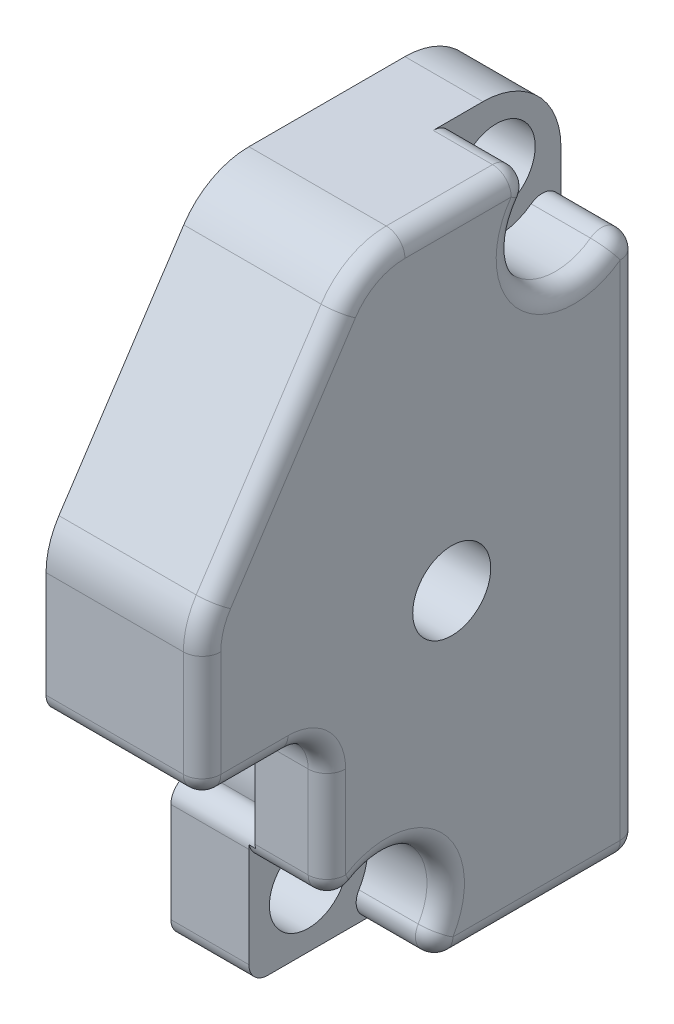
ISO-10303-21;
HEADER;
FILE_DESCRIPTION(('STEP AP214'),'2;1');
FILE_NAME('part.step','',(''),(''),'','','');
FILE_SCHEMA(('AUTOMOTIVE_DESIGN { 1 0 10303 214 1 1 1 1 }'));
ENDSEC;
DATA;
#1=APPLICATION_CONTEXT('core data for automotive mechanical design processes');
#2=APPLICATION_PROTOCOL_DEFINITION('international standard','automotive_design',2000,#1);
#3=PRODUCT_CONTEXT('',#1,'mechanical');
#4=PRODUCT('Part','Part','',(#3));
#5=PRODUCT_RELATED_PRODUCT_CATEGORY('part','',(#4));
#6=PRODUCT_DEFINITION_FORMATION('','',#4);
#7=PRODUCT_DEFINITION_CONTEXT('part definition',#1,'design');
#8=PRODUCT_DEFINITION('design','',#6,#7);
#9=PRODUCT_DEFINITION_SHAPE('','',#8);
#10=(LENGTH_UNIT() NAMED_UNIT(*) SI_UNIT(.MILLI.,.METRE.));
#11=(NAMED_UNIT(*) PLANE_ANGLE_UNIT() SI_UNIT($,.RADIAN.));
#12=(NAMED_UNIT(*) SI_UNIT($,.STERADIAN.) SOLID_ANGLE_UNIT());
#13=UNCERTAINTY_MEASURE_WITH_UNIT(LENGTH_MEASURE(1.E-05),#10,'distance_accuracy_value','');
#14=(GEOMETRIC_REPRESENTATION_CONTEXT(3) GLOBAL_UNCERTAINTY_ASSIGNED_CONTEXT((#13)) GLOBAL_UNIT_ASSIGNED_CONTEXT((#10,
#11,#12)) REPRESENTATION_CONTEXT('',''));
#15=CARTESIAN_POINT('',(0.,0.,0.));
#16=DIRECTION('',(0.,0.,1.));
#17=DIRECTION('',(1.,0.,0.));
#18=AXIS2_PLACEMENT_3D('',#15,#16,#17);
#19=CARTESIAN_POINT('',(6.35,-4.1275,5.08));
#20=DIRECTION('',(0.,0.,-1.));
#21=DIRECTION('',(0.,1.,0.));
#22=AXIS2_PLACEMENT_3D('',#19,#20,#21);
#23=PLANE('',#22);
#24=DIRECTION('',(0.,-1.,0.));
#25=VECTOR('',#24,1.);
#26=CARTESIAN_POINT('',(0.,-4.1275,5.08));
#27=LINE('',#26,#25);
#28=CARTESIAN_POINT('',(0.,-8.16814645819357,5.08));
#29=VERTEX_POINT('',#28);
#30=CARTESIAN_POINT('',(0.,-12.228916,5.08));
#31=VERTEX_POINT('',#30);
#32=EDGE_CURVE('E529',#29,#31,#27,.T.);
#33=ORIENTED_EDGE('',*,*,#32,.T.);
#34=DIRECTION('',(-1.,0.,0.));
#35=VECTOR('',#34,1.);
#36=CARTESIAN_POINT('',(6.35,-12.228916,5.08));
#37=LINE('',#36,#35);
#38=CARTESIAN_POINT('',(3.175,-12.228916,5.08));
#39=VERTEX_POINT('',#38);
#40=EDGE_CURVE('E600',#31,#39,#37,.F.);
#41=ORIENTED_EDGE('',*,*,#40,.T.);
#42=DIRECTION('',(0.,-1.,0.));
#43=VECTOR('',#42,1.);
#44=CARTESIAN_POINT('',(3.175,-9.57841867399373,5.08));
#45=LINE('',#44,#43);
#46=CARTESIAN_POINT('',(3.175,-8.16814645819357,5.08));
#47=VERTEX_POINT('',#46);
#48=EDGE_CURVE('E766',#47,#39,#45,.T.);
#49=ORIENTED_EDGE('',*,*,#48,.F.);
#50=DIRECTION('',(-1.,0.,0.));
#51=VECTOR('',#50,1.);
#52=CARTESIAN_POINT('',(6.35,-8.16814645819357,5.08));
#53=LINE('',#52,#51);
#54=EDGE_CURVE('E599',#47,#29,#53,.T.);
#55=ORIENTED_EDGE('',*,*,#54,.T.);
#56=EDGE_LOOP('',(#33,#41,#49,#55));
#57=FACE_BOUND('',#56,.T.);
#58=ADVANCED_FACE('F39',(#57),#23,.F.);
#59=CARTESIAN_POINT('',(6.35,10.250084,-4.445));
#60=DIRECTION('',(-1.,0.,0.));
#61=DIRECTION('',(0.,0.,1.));
#62=AXIS2_PLACEMENT_3D('',#59,#60,#61);
#63=CYLINDRICAL_SURFACE('',#62,3.175);
#64=CARTESIAN_POINT('',(3.175,10.250084,-4.445));
#65=DIRECTION('',(1.,0.,0.));
#66=DIRECTION('',(0.,0.,1.));
#67=AXIS2_PLACEMENT_3D('',#64,#65,#66);
#68=CIRCLE('',#67,3.175);
#69=CARTESIAN_POINT('',(3.175,10.250084,-7.62));
#70=VERTEX_POINT('',#69);
#71=CARTESIAN_POINT('',(3.175,13.425084,-4.445));
#72=VERTEX_POINT('',#71);
#73=EDGE_CURVE('E759',#70,#72,#68,.T.);
#74=ORIENTED_EDGE('',*,*,#73,.F.);
#75=DIRECTION('',(-1.,0.,0.));
#76=VECTOR('',#75,1.);
#77=CARTESIAN_POINT('',(6.35,10.250084,-7.62));
#78=LINE('',#77,#76);
#79=CARTESIAN_POINT('',(0.,10.250084,-7.62));
#80=VERTEX_POINT('',#79);
#81=EDGE_CURVE('E818',#70,#80,#78,.T.);
#82=ORIENTED_EDGE('',*,*,#81,.T.);
#83=CARTESIAN_POINT('',(0.,10.250084,-4.445));
#84=DIRECTION('',(1.,0.,0.));
#85=DIRECTION('',(0.,0.,1.));
#86=AXIS2_PLACEMENT_3D('',#83,#84,#85);
#87=CIRCLE('',#86,3.175);
#88=CARTESIAN_POINT('',(0.,13.425084,-4.445));
#89=VERTEX_POINT('',#88);
#90=EDGE_CURVE('E499',#80,#89,#87,.T.);
#91=ORIENTED_EDGE('',*,*,#90,.T.);
#92=DIRECTION('',(-1.,0.,0.));
#93=VECTOR('',#92,1.);
#94=CARTESIAN_POINT('',(6.35,13.425084,-4.445));
#95=LINE('',#94,#93);
#96=EDGE_CURVE('E816',#72,#89,#95,.T.);
#97=ORIENTED_EDGE('',*,*,#96,.F.);
#98=EDGE_LOOP('',(#74,#82,#91,#97));
#99=FACE_BOUND('',#98,.T.);
#100=ADVANCED_FACE('F685',(#99),#63,.T.);
#101=CARTESIAN_POINT('',(6.35,10.7888993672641,-4.98381536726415));
#102=DIRECTION('',(1.,0.,0.));
#103=DIRECTION('',(0.,0.,-1.));
#104=AXIS2_PLACEMENT_3D('',#101,#102,#103);
#105=CYLINDRICAL_SURFACE('',#104,1.5875);
#106=CARTESIAN_POINT('',(0.,10.7888993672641,-4.98381536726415));
#107=DIRECTION('',(-1.,0.,0.));
#108=DIRECTION('',(0.,0.,1.));
#109=AXIS2_PLACEMENT_3D('',#106,#107,#108);
#110=CIRCLE('',#109,1.5875);
#111=CARTESIAN_POINT('',(0.,10.7888993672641,-3.39631536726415));
#112=VERTEX_POINT('',#111);
#113=EDGE_CURVE('E724',#112,#112,#110,.T.);
#114=ORIENTED_EDGE('',*,*,#113,.T.);
#115=EDGE_LOOP('',(#114));
#116=FACE_BOUND('',#115,.T.);
#117=CARTESIAN_POINT('',(3.175,10.7888993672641,-4.98381536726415));
#118=DIRECTION('',(1.,0.,0.));
#119=DIRECTION('',(0.,0.,-1.));
#120=AXIS2_PLACEMENT_3D('',#117,#118,#119);
#121=CIRCLE('',#120,1.5875);
#122=CARTESIAN_POINT('',(3.175,10.7888993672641,-6.57131536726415));
#123=VERTEX_POINT('',#122);
#124=EDGE_CURVE('E758',#123,#123,#121,.F.);
#125=ORIENTED_EDGE('',*,*,#124,.F.);
#126=EDGE_LOOP('',(#125));
#127=FACE_BOUND('',#126,.T.);
#128=ADVANCED_FACE('F691',(#116,#127),#105,.F.);
#129=CARTESIAN_POINT('',(6.35,-10.5694693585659,2.65855335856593));
#130=DIRECTION('',(1.,0.,0.));
#131=DIRECTION('',(0.,0.,-1.));
#132=AXIS2_PLACEMENT_3D('',#129,#130,#131);
#133=CYLINDRICAL_SURFACE('',#132,1.5875);
#134=CARTESIAN_POINT('',(0.,-10.5694693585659,2.65855335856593));
#135=DIRECTION('',(-1.,0.,0.));
#136=DIRECTION('',(0.,0.,1.));
#137=AXIS2_PLACEMENT_3D('',#134,#135,#136);
#138=CIRCLE('',#137,1.5875);
#139=CARTESIAN_POINT('',(0.,-10.5694693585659,4.24605335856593));
#140=VERTEX_POINT('',#139);
#141=EDGE_CURVE('E755',#140,#140,#138,.T.);
#142=ORIENTED_EDGE('',*,*,#141,.T.);
#143=EDGE_LOOP('',(#142));
#144=FACE_BOUND('',#143,.T.);
#145=CARTESIAN_POINT('',(3.175,-10.5694693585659,2.65855335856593));
#146=DIRECTION('',(1.,0.,0.));
#147=DIRECTION('',(0.,0.,-1.));
#148=AXIS2_PLACEMENT_3D('',#145,#146,#147);
#149=CIRCLE('',#148,1.5875);
#150=CARTESIAN_POINT('',(3.175,-10.5694693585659,1.07105335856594));
#151=VERTEX_POINT('',#150);
#152=EDGE_CURVE('E765',#151,#151,#149,.F.);
#153=ORIENTED_EDGE('',*,*,#152,.F.);
#154=EDGE_LOOP('',(#153));
#155=FACE_BOUND('',#154,.T.);
#156=ADVANCED_FACE('F912',(#144,#155),#133,.F.);
#157=CARTESIAN_POINT('',(6.35,10.250084,-4.445));
#158=DIRECTION('',(-1.,0.,0.));
#159=DIRECTION('',(0.,0.,1.));
#160=AXIS2_PLACEMENT_3D('',#157,#158,#159);
#161=PLANE('',#160);
#162=CARTESIAN_POINT('',(6.35,-10.5694693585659,2.65855335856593));
#163=DIRECTION('',(-1.,0.,0.));
#164=DIRECTION('',(0.,0.,1.));
#165=AXIS2_PLACEMENT_3D('',#162,#163,#164);
#166=CIRCLE('',#165,3.175);
#167=CARTESIAN_POINT('',(6.35,-7.86265169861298,4.318));
#168=VERTEX_POINT('',#167);
#169=CARTESIAN_POINT('',(6.35,-12.228916,-0.0482643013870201));
#170=VERTEX_POINT('',#169);
#171=EDGE_CURVE('E643',#168,#170,#166,.T.);
#172=ORIENTED_EDGE('',*,*,#171,.T.);
#173=DIRECTION('',(0.,0.,-1.));
#174=VECTOR('',#173,1.);
#175=CARTESIAN_POINT('',(6.35,-12.228916,-4.445));
#176=LINE('',#175,#174);
#177=CARTESIAN_POINT('',(6.35,-12.228916,-6.858));
#178=VERTEX_POINT('',#177);
#179=EDGE_CURVE('E462',#170,#178,#176,.T.);
#180=ORIENTED_EDGE('',*,*,#179,.T.);
#181=DIRECTION('',(0.,1.,0.));
#182=VECTOR('',#181,1.);
#183=CARTESIAN_POINT('',(6.35,10.250084,-6.858));
#184=LINE('',#183,#182);
#185=CARTESIAN_POINT('',(6.35,8.2260772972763,-6.858));
#186=VERTEX_POINT('',#185);
#187=EDGE_CURVE('E460',#178,#186,#184,.T.);
#188=ORIENTED_EDGE('',*,*,#187,.T.);
#189=CARTESIAN_POINT('',(6.35,10.7888993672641,-4.98381536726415));
#190=DIRECTION('',(-1.,0.,0.));
#191=DIRECTION('',(0.,0.,1.));
#192=AXIS2_PLACEMENT_3D('',#189,#190,#191);
#193=CIRCLE('',#192,3.175);
#194=CARTESIAN_POINT('',(6.35,12.663084,-2.42099329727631));
#195=VERTEX_POINT('',#194);
#196=EDGE_CURVE('E636',#186,#195,#193,.T.);
#197=ORIENTED_EDGE('',*,*,#196,.T.);
#198=DIRECTION('',(0.,0.,1.));
#199=VECTOR('',#198,1.);
#200=CARTESIAN_POINT('',(6.35,12.663084,-4.445));
#201=LINE('',#200,#199);
#202=CARTESIAN_POINT('',(6.35,12.663084,1.905));
#203=VERTEX_POINT('',#202);
#204=EDGE_CURVE('E458',#195,#203,#201,.T.);
#205=ORIENTED_EDGE('',*,*,#204,.T.);
#206=CARTESIAN_POINT('',(6.35,10.250084,1.905));
#207=DIRECTION('',(-1.,0.,0.));
#208=DIRECTION('',(0.,0.,1.));
#209=AXIS2_PLACEMENT_3D('',#206,#207,#208);
#210=CIRCLE('',#209,2.413);
#211=CARTESIAN_POINT('',(6.35,11.577690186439,3.91995181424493));
#212=VERTEX_POINT('',#211);
#213=EDGE_CURVE('E456',#203,#212,#210,.F.);
#214=ORIENTED_EDGE('',*,*,#213,.T.);
#215=DIRECTION('',(0.,-0.835040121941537,0.550189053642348));
#216=VECTOR('',#215,1.);
#217=CARTESIAN_POINT('',(6.35,14.495070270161,1.997756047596));
#218=LINE('',#217,#216);
#219=CARTESIAN_POINT('',(6.35,3.86760618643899,8.99995181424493));
#220=VERTEX_POINT('',#219);
#221=EDGE_CURVE('E454',#212,#220,#218,.T.);
#222=ORIENTED_EDGE('',*,*,#221,.T.);
#223=CARTESIAN_POINT('',(6.35,2.54,6.985));
#224=DIRECTION('',(-1.,0.,0.));
#225=DIRECTION('',(0.,0.,1.));
#226=AXIS2_PLACEMENT_3D('',#223,#224,#225);
#227=CIRCLE('',#226,2.413);
#228=CARTESIAN_POINT('',(6.35,2.54,9.398));
#229=VERTEX_POINT('',#228);
#230=EDGE_CURVE('E452',#220,#229,#227,.F.);
#231=ORIENTED_EDGE('',*,*,#230,.T.);
#232=DIRECTION('',(0.,-1.,0.));
#233=VECTOR('',#232,1.);
#234=CARTESIAN_POINT('',(6.35,10.250084,9.398));
#235=LINE('',#234,#233);
#236=CARTESIAN_POINT('',(6.35,-1.778,9.398));
#237=VERTEX_POINT('',#236);
#238=EDGE_CURVE('E450',#229,#237,#235,.T.);
#239=ORIENTED_EDGE('',*,*,#238,.T.);
#240=DIRECTION('',(0.,0.,-1.));
#241=VECTOR('',#240,1.);
#242=CARTESIAN_POINT('',(6.35,-1.778,-4.445));
#243=LINE('',#242,#241);
#244=CARTESIAN_POINT('',(6.35,-1.778,6.6675));
#245=VERTEX_POINT('',#244);
#246=EDGE_CURVE('E448',#237,#245,#243,.T.);
#247=ORIENTED_EDGE('',*,*,#246,.T.);
#248=CARTESIAN_POINT('',(6.35,-4.1275,6.6675));
#249=DIRECTION('',(-1.,0.,0.));
#250=DIRECTION('',(0.,0.,1.));
#251=AXIS2_PLACEMENT_3D('',#248,#249,#250);
#252=CIRCLE('',#251,2.3495);
#253=CARTESIAN_POINT('',(6.35,-4.1275,4.318));
#254=VERTEX_POINT('',#253);
#255=EDGE_CURVE('E446',#245,#254,#252,.T.);
#256=ORIENTED_EDGE('',*,*,#255,.T.);
#257=DIRECTION('',(0.,-1.,0.));
#258=VECTOR('',#257,1.);
#259=CARTESIAN_POINT('',(6.35,10.250084,4.31800000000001));
#260=LINE('',#259,#258);
#261=EDGE_CURVE('E415',#254,#168,#260,.T.);
#262=ORIENTED_EDGE('',*,*,#261,.T.);
#263=EDGE_LOOP('',(#172,#180,#188,#197,#205,#214,#222,#231,#239,#247,#256,#262));
#264=FACE_BOUND('',#263,.T.);
#265=CARTESIAN_POINT('',(6.35,0.,0.));
#266=DIRECTION('',(1.,0.,0.));
#267=DIRECTION('',(0.,0.,-1.));
#268=AXIS2_PLACEMENT_3D('',#265,#266,#267);
#269=CIRCLE('',#268,1.5875);
#270=CARTESIAN_POINT('',(6.35,0.,-1.5875));
#271=VERTEX_POINT('',#270);
#272=EDGE_CURVE('E525',#271,#271,#269,.T.);
#273=ORIENTED_EDGE('',*,*,#272,.F.);
#274=EDGE_LOOP('',(#273));
#275=FACE_BOUND('',#274,.T.);
#276=ADVANCED_FACE('F634',(#264,#275),#161,.F.);
#277=CARTESIAN_POINT('',(6.35,0.,0.));
#278=DIRECTION('',(-1.,0.,0.));
#279=DIRECTION('',(0.,0.,1.));
#280=AXIS2_PLACEMENT_3D('',#277,#278,#279);
#281=CYLINDRICAL_SURFACE('',#280,1.5875);
#282=ORIENTED_EDGE('',*,*,#272,.T.);
#283=EDGE_LOOP('',(#282));
#284=FACE_BOUND('',#283,.T.);
#285=CARTESIAN_POINT('',(3.81,0.,0.));
#286=DIRECTION('',(-1.,0.,0.));
#287=DIRECTION('',(0.,0.,1.));
#288=AXIS2_PLACEMENT_3D('',#285,#286,#287);
#289=CIRCLE('',#288,1.5875);
#290=CARTESIAN_POINT('',(3.81,0.,1.5875));
#291=VERTEX_POINT('',#290);
#292=EDGE_CURVE('E747',#291,#291,#289,.T.);
#293=ORIENTED_EDGE('',*,*,#292,.T.);
#294=EDGE_LOOP('',(#293));
#295=FACE_BOUND('',#294,.T.);
#296=ADVANCED_FACE('F712',(#284,#295),#281,.F.);
#297=CARTESIAN_POINT('',(0.,10.250084,-4.445));
#298=DIRECTION('',(-1.,0.,0.));
#299=DIRECTION('',(0.,0.,1.));
#300=AXIS2_PLACEMENT_3D('',#297,#298,#299);
#301=PLANE('',#300);
#302=ORIENTED_EDGE('',*,*,#113,.F.);
#303=EDGE_LOOP('',(#302));
#304=FACE_BOUND('',#303,.T.);
#305=DIRECTION('',(0.,0.,1.));
#306=VECTOR('',#305,1.);
#307=CARTESIAN_POINT('',(0.,7.08025000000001,-4.44499999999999));
#308=LINE('',#307,#306);
#309=CARTESIAN_POINT('',(0.,7.08025,-6.858));
#310=VERTEX_POINT('',#309);
#311=CARTESIAN_POINT('',(0.,7.08025000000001,-4.64028178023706));
#312=VERTEX_POINT('',#311);
#313=EDGE_CURVE('E494',#310,#312,#308,.T.);
#314=ORIENTED_EDGE('',*,*,#313,.T.);
#315=CARTESIAN_POINT('',(0.,7.84225000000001,-4.64028178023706));
#316=DIRECTION('',(-1.,0.,0.));
#317=DIRECTION('',(0.,0.,1.));
#318=AXIS2_PLACEMENT_3D('',#315,#316,#317);
#319=CIRCLE('',#318,0.762);
#320=CARTESIAN_POINT('',(0.,7.18645209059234,-4.25224427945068));
#321=VERTEX_POINT('',#320);
#322=EDGE_CURVE('E340',#312,#321,#319,.T.);
#323=ORIENTED_EDGE('',*,*,#322,.T.);
#324=CARTESIAN_POINT('',(0.,0.,0.));
#325=DIRECTION('',(-1.,0.,0.));
#326=DIRECTION('',(0.,0.,1.));
#327=AXIS2_PLACEMENT_3D('',#324,#325,#326);
#328=CIRCLE('',#327,8.35025000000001);
#329=CARTESIAN_POINT('',(0.,-1.62931707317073,8.18974974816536));
#330=VERTEX_POINT('',#329);
#331=EDGE_CURVE('E319',#330,#321,#328,.T.);
#332=ORIENTED_EDGE('',*,*,#331,.F.);
#333=CARTESIAN_POINT('',(0.,-1.778,8.93710333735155));
#334=DIRECTION('',(-1.,0.,0.));
#335=DIRECTION('',(0.,0.,1.));
#336=AXIS2_PLACEMENT_3D('',#333,#334,#335);
#337=CIRCLE('',#336,0.762);
#338=CARTESIAN_POINT('',(0.,-2.54,8.93710333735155));
#339=VERTEX_POINT('',#338);
#340=EDGE_CURVE('E334',#330,#339,#337,.T.);
#341=ORIENTED_EDGE('',*,*,#340,.T.);
#342=DIRECTION('',(0.,0.,-1.));
#343=VECTOR('',#342,1.);
#344=CARTESIAN_POINT('',(0.,-2.54,6.6675));
#345=LINE('',#344,#343);
#346=CARTESIAN_POINT('',(0.,-2.54,9.398));
#347=VERTEX_POINT('',#346);
#348=EDGE_CURVE('E798',#347,#339,#345,.T.);
#349=ORIENTED_EDGE('',*,*,#348,.F.);
#350=CARTESIAN_POINT('',(0.,-1.778,9.398));
#351=DIRECTION('',(-1.,0.,0.));
#352=DIRECTION('',(0.,0.,1.));
#353=AXIS2_PLACEMENT_3D('',#350,#351,#352);
#354=CIRCLE('',#353,0.762);
#355=CARTESIAN_POINT('',(0.,-1.778,10.16));
#356=VERTEX_POINT('',#355);
#357=EDGE_CURVE('E338',#347,#356,#354,.T.);
#358=ORIENTED_EDGE('',*,*,#357,.T.);
#359=DIRECTION('',(0.,-1.,0.));
#360=VECTOR('',#359,1.);
#361=CARTESIAN_POINT('',(0.,2.54,10.16));
#362=LINE('',#361,#360);
#363=CARTESIAN_POINT('',(0.,2.54,10.16));
#364=VERTEX_POINT('',#363);
#365=EDGE_CURVE('E801',#364,#356,#362,.T.);
#366=ORIENTED_EDGE('',*,*,#365,.F.);
#367=CARTESIAN_POINT('',(0.,2.54,6.985));
#368=DIRECTION('',(1.,0.,0.));
#369=DIRECTION('',(0.,0.,1.));
#370=AXIS2_PLACEMENT_3D('',#367,#368,#369);
#371=CIRCLE('',#370,3.175);
#372=CARTESIAN_POINT('',(0.,4.28685024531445,9.63625238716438));
#373=VERTEX_POINT('',#372);
#374=EDGE_CURVE('E805',#373,#364,#371,.T.);
#375=ORIENTED_EDGE('',*,*,#374,.F.);
#376=DIRECTION('',(0.,-0.835040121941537,0.550189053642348));
#377=VECTOR('',#376,1.);
#378=CARTESIAN_POINT('',(0.,11.9969342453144,4.55625238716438));
#379=LINE('',#378,#377);
#380=CARTESIAN_POINT('',(0.,11.9969342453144,4.55625238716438));
#381=VERTEX_POINT('',#380);
#382=EDGE_CURVE('E856',#381,#373,#379,.T.);
#383=ORIENTED_EDGE('',*,*,#382,.F.);
#384=CARTESIAN_POINT('',(0.,10.250084,1.905));
#385=DIRECTION('',(1.,0.,0.));
#386=DIRECTION('',(0.,0.,1.));
#387=AXIS2_PLACEMENT_3D('',#384,#385,#386);
#388=CIRCLE('',#387,3.175);
#389=CARTESIAN_POINT('',(0.,13.425084,1.905));
#390=VERTEX_POINT('',#389);
#391=EDGE_CURVE('E851',#390,#381,#388,.T.);
#392=ORIENTED_EDGE('',*,*,#391,.F.);
#393=DIRECTION('',(0.,0.,1.));
#394=VECTOR('',#393,1.);
#395=CARTESIAN_POINT('',(0.,13.425084,1.905));
#396=LINE('',#395,#394);
#397=EDGE_CURVE('E848',#89,#390,#396,.T.);
#398=ORIENTED_EDGE('',*,*,#397,.F.);
#399=ORIENTED_EDGE('',*,*,#90,.F.);
#400=DIRECTION('',(0.,1.,0.));
#401=VECTOR('',#400,1.);
#402=CARTESIAN_POINT('',(0.,-12.990916,-7.62));
#403=LINE('',#402,#401);
#404=CARTESIAN_POINT('',(0.,7.84225000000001,-7.62));
#405=VERTEX_POINT('',#404);
#406=EDGE_CURVE('E500',#405,#80,#403,.T.);
#407=ORIENTED_EDGE('',*,*,#406,.F.);
#408=CARTESIAN_POINT('',(0.,7.84225000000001,-6.858));
#409=DIRECTION('',(-1.,0.,0.));
#410=DIRECTION('',(0.,0.,1.));
#411=AXIS2_PLACEMENT_3D('',#408,#409,#410);
#412=CIRCLE('',#411,0.762);
#413=EDGE_CURVE('E336',#405,#310,#412,.T.);
#414=ORIENTED_EDGE('',*,*,#413,.T.);
#415=EDGE_LOOP('',(#314,#323,#332,#341,#349,#358,#366,#375,#383,#392,#398,#399,#407,#414));
#416=FACE_BOUND('',#415,.T.);
#417=ADVANCED_FACE('F704',(#304,#416),#301,.T.);
#418=CARTESIAN_POINT('',(6.35,-12.990916,-7.62));
#419=DIRECTION('',(0.,0.,1.));
#420=DIRECTION('',(1.,0.,0.));
#421=AXIS2_PLACEMENT_3D('',#418,#419,#420);
#422=PLANE('',#421);
#423=DIRECTION('',(0.,-1.,0.));
#424=VECTOR('',#423,1.);
#425=CARTESIAN_POINT('',(3.429,7.08025,-7.62));
#426=LINE('',#425,#424);
#427=CARTESIAN_POINT('',(3.429,7.84225000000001,-7.62));
#428=VERTEX_POINT('',#427);
#429=CARTESIAN_POINT('',(3.429,-6.19125000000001,-7.62));
#430=VERTEX_POINT('',#429);
#431=EDGE_CURVE('E620',#428,#430,#426,.T.);
#432=ORIENTED_EDGE('',*,*,#431,.F.);
#433=DIRECTION('',(1.,0.,0.));
#434=VECTOR('',#433,1.);
#435=CARTESIAN_POINT('',(0.,7.84225000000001,-7.62));
#436=LINE('',#435,#434);
#437=EDGE_CURVE('E521',#428,#405,#436,.F.);
#438=ORIENTED_EDGE('',*,*,#437,.T.);
#439=ORIENTED_EDGE('',*,*,#406,.T.);
#440=ORIENTED_EDGE('',*,*,#81,.F.);
#441=DIRECTION('',(0.,-1.,0.));
#442=VECTOR('',#441,1.);
#443=CARTESIAN_POINT('',(3.175,10.7888993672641,-7.62));
#444=LINE('',#443,#442);
#445=CARTESIAN_POINT('',(3.175,8.2260772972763,-7.62));
#446=VERTEX_POINT('',#445);
#447=EDGE_CURVE('E667',#70,#446,#444,.T.);
#448=ORIENTED_EDGE('',*,*,#447,.T.);
#449=DIRECTION('',(1.,0.,0.));
#450=VECTOR('',#449,1.);
#451=CARTESIAN_POINT('',(6.35,8.2260772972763,-7.62));
#452=LINE('',#451,#450);
#453=CARTESIAN_POINT('',(5.588,8.2260772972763,-7.62));
#454=VERTEX_POINT('',#453);
#455=EDGE_CURVE('E625',#446,#454,#452,.T.);
#456=ORIENTED_EDGE('',*,*,#455,.T.);
#457=DIRECTION('',(0.,1.,0.));
#458=VECTOR('',#457,1.);
#459=CARTESIAN_POINT('',(5.588,-12.990916,-7.62));
#460=LINE('',#459,#458);
#461=CARTESIAN_POINT('',(5.588,-12.228916,-7.62));
#462=VERTEX_POINT('',#461);
#463=EDGE_CURVE('E514',#454,#462,#460,.F.);
#464=ORIENTED_EDGE('',*,*,#463,.T.);
#465=DIRECTION('',(-1.,0.,0.));
#466=VECTOR('',#465,1.);
#467=CARTESIAN_POINT('',(6.35,-12.228916,-7.62));
#468=LINE('',#467,#466);
#469=CARTESIAN_POINT('',(0.,-12.228916,-7.62));
#470=VERTEX_POINT('',#469);
#471=EDGE_CURVE('E516',#462,#470,#468,.T.);
#472=ORIENTED_EDGE('',*,*,#471,.T.);
#473=CARTESIAN_POINT('',(0.,-6.19125000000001,-7.62));
#474=VERTEX_POINT('',#473);
#475=EDGE_CURVE('E495',#470,#474,#403,.T.);
#476=ORIENTED_EDGE('',*,*,#475,.T.);
#477=DIRECTION('',(-1.,0.,0.));
#478=VECTOR('',#477,1.);
#479=CARTESIAN_POINT('',(6.35,-6.19125000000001,-7.62));
#480=LINE('',#479,#478);
#481=EDGE_CURVE('E518',#474,#430,#480,.F.);
#482=ORIENTED_EDGE('',*,*,#481,.T.);
#483=EDGE_LOOP('',(#432,#438,#439,#440,#448,#456,#464,#472,#476,#482));
#484=FACE_BOUND('',#483,.T.);
#485=ADVANCED_FACE('F619',(#484),#422,.F.);
#486=CARTESIAN_POINT('',(6.35,-4.1275,6.6675));
#487=DIRECTION('',(-1.,0.,0.));
#488=DIRECTION('',(0.,0.,1.));
#489=AXIS2_PLACEMENT_3D('',#486,#487,#488);
#490=CYLINDRICAL_SURFACE('',#489,1.5875);
#491=DIRECTION('',(-1.,0.,0.));
#492=VECTOR('',#491,1.);
#493=CARTESIAN_POINT('',(6.35,-4.1275,5.08));
#494=LINE('',#493,#492);
#495=CARTESIAN_POINT('',(5.588,-4.1275,5.08));
#496=VERTEX_POINT('',#495);
#497=CARTESIAN_POINT('',(3.429,-4.1275,5.08));
#498=VERTEX_POINT('',#497);
#499=EDGE_CURVE('E305',#496,#498,#494,.T.);
#500=ORIENTED_EDGE('',*,*,#499,.F.);
#501=CARTESIAN_POINT('',(5.588,-4.1275,6.6675));
#502=DIRECTION('',(-1.,0.,0.));
#503=DIRECTION('',(0.,0.,1.));
#504=AXIS2_PLACEMENT_3D('',#501,#502,#503);
#505=CIRCLE('',#504,1.5875);
#506=CARTESIAN_POINT('',(5.588,-2.54,6.6675));
#507=VERTEX_POINT('',#506);
#508=EDGE_CURVE('E300',#496,#507,#505,.F.);
#509=ORIENTED_EDGE('',*,*,#508,.T.);
#510=DIRECTION('',(-1.,0.,0.));
#511=VECTOR('',#510,1.);
#512=CARTESIAN_POINT('',(6.35,-2.54,6.6675));
#513=LINE('',#512,#511);
#514=CARTESIAN_POINT('',(3.429,-2.54,6.6675));
#515=VERTEX_POINT('',#514);
#516=EDGE_CURVE('E294',#507,#515,#513,.T.);
#517=ORIENTED_EDGE('',*,*,#516,.T.);
#518=CARTESIAN_POINT('',(3.429,-4.1275,6.6675));
#519=DIRECTION('',(-1.,0.,0.));
#520=DIRECTION('',(0.,0.,1.));
#521=AXIS2_PLACEMENT_3D('',#518,#519,#520);
#522=CIRCLE('',#521,1.5875);
#523=EDGE_CURVE('E298',#498,#515,#522,.F.);
#524=ORIENTED_EDGE('',*,*,#523,.F.);
#525=EDGE_LOOP('',(#500,#509,#517,#524));
#526=FACE_BOUND('',#525,.T.);
#527=ADVANCED_FACE('F297',(#526),#490,.F.);
#528=ORIENTED_EDGE('',*,*,#141,.F.);
#529=EDGE_LOOP('',(#528));
#530=FACE_BOUND('',#529,.T.);
#531=DIRECTION('',(0.,0.,-1.));
#532=VECTOR('',#531,1.);
#533=CARTESIAN_POINT('',(0.,-12.990916,5.08));
#534=LINE('',#533,#532);
#535=CARTESIAN_POINT('',(0.,-12.990916,4.318));
#536=VERTEX_POINT('',#535);
#537=CARTESIAN_POINT('',(0.,-12.990916,-6.858));
#538=VERTEX_POINT('',#537);
#539=EDGE_CURVE('E505',#536,#538,#534,.T.);
#540=ORIENTED_EDGE('',*,*,#539,.F.);
#541=CARTESIAN_POINT('',(0.,-12.228916,4.318));
#542=DIRECTION('',(-1.,0.,0.));
#543=DIRECTION('',(0.,0.,1.));
#544=AXIS2_PLACEMENT_3D('',#541,#542,#543);
#545=CIRCLE('',#544,0.762);
#546=EDGE_CURVE('E605',#536,#31,#545,.T.);
#547=ORIENTED_EDGE('',*,*,#546,.T.);
#548=ORIENTED_EDGE('',*,*,#32,.F.);
#549=CARTESIAN_POINT('',(0.,-8.16814645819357,4.318));
#550=DIRECTION('',(-1.,0.,0.));
#551=DIRECTION('',(0.,0.,1.));
#552=AXIS2_PLACEMENT_3D('',#549,#550,#551);
#553=CIRCLE('',#552,0.762);
#554=CARTESIAN_POINT('',(0.,-7.49448489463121,3.9618762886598));
#555=VERTEX_POINT('',#554);
#556=EDGE_CURVE('E492',#29,#555,#553,.T.);
#557=ORIENTED_EDGE('',*,*,#556,.T.);
#558=CARTESIAN_POINT('',(0.,0.,0.));
#559=DIRECTION('',(-1.,0.,0.));
#560=DIRECTION('',(0.,0.,1.));
#561=AXIS2_PLACEMENT_3D('',#558,#559,#560);
#562=CIRCLE('',#561,8.47725);
#563=CARTESIAN_POINT('',(0.,-5.68063144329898,-6.29239175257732));
#564=VERTEX_POINT('',#563);
#565=EDGE_CURVE('E331',#564,#555,#562,.T.);
#566=ORIENTED_EDGE('',*,*,#565,.F.);
#567=CARTESIAN_POINT('',(0.,-6.19125000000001,-6.858));
#568=DIRECTION('',(-1.,0.,0.));
#569=DIRECTION('',(0.,0.,1.));
#570=AXIS2_PLACEMENT_3D('',#567,#568,#569);
#571=CIRCLE('',#570,0.762);
#572=EDGE_CURVE('E607',#564,#474,#571,.T.);
#573=ORIENTED_EDGE('',*,*,#572,.T.);
#574=ORIENTED_EDGE('',*,*,#475,.F.);
#575=CARTESIAN_POINT('',(0.,-12.228916,-6.858));
#576=DIRECTION('',(-1.,0.,0.));
#577=DIRECTION('',(0.,0.,1.));
#578=AXIS2_PLACEMENT_3D('',#575,#576,#577);
#579=CIRCLE('',#578,0.762);
#580=EDGE_CURVE('E547',#470,#538,#579,.T.);
#581=ORIENTED_EDGE('',*,*,#580,.T.);
#582=EDGE_LOOP('',(#540,#547,#548,#557,#566,#573,#574,#581));
#583=FACE_BOUND('',#582,.T.);
#584=ADVANCED_FACE('F610',(#530,#583),#301,.T.);
#585=DIRECTION('',(0.,1.,0.));
#586=VECTOR('',#585,1.);
#587=CARTESIAN_POINT('',(3.429,-4.1275,5.08));
#588=LINE('',#587,#586);
#589=CARTESIAN_POINT('',(3.429,-7.86265169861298,5.08));
#590=VERTEX_POINT('',#589);
#591=EDGE_CURVE('E56',#590,#498,#588,.T.);
#592=ORIENTED_EDGE('',*,*,#591,.F.);
#593=DIRECTION('',(1.,0.,0.));
#594=VECTOR('',#593,1.);
#595=CARTESIAN_POINT('',(6.35,-7.86265169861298,5.08));
#596=LINE('',#595,#594);
#597=CARTESIAN_POINT('',(5.588,-7.86265169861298,5.08));
#598=VERTEX_POINT('',#597);
#599=EDGE_CURVE('E566',#590,#598,#596,.T.);
#600=ORIENTED_EDGE('',*,*,#599,.T.);
#601=DIRECTION('',(0.,-1.,0.));
#602=VECTOR('',#601,1.);
#603=CARTESIAN_POINT('',(5.588,-4.1275,5.08));
#604=LINE('',#603,#602);
#605=EDGE_CURVE('E416',#598,#496,#604,.F.);
#606=ORIENTED_EDGE('',*,*,#605,.T.);
#607=ORIENTED_EDGE('',*,*,#499,.T.);
#608=EDGE_LOOP('',(#592,#600,#606,#607));
#609=FACE_BOUND('',#608,.T.);
#610=ADVANCED_FACE('F687',(#609),#23,.F.);
#611=CARTESIAN_POINT('',(6.35,-12.990916,5.08));
#612=DIRECTION('',(0.,1.,0.));
#613=DIRECTION('',(0.,0.,1.));
#614=AXIS2_PLACEMENT_3D('',#611,#612,#613);
#615=PLANE('',#614);
#616=DIRECTION('',(0.,0.,-1.));
#617=VECTOR('',#616,1.);
#618=CARTESIAN_POINT('',(3.175,-12.990916,5.08));
#619=LINE('',#618,#617);
#620=CARTESIAN_POINT('',(3.175,-12.990916,4.318));
#621=VERTEX_POINT('',#620);
#622=CARTESIAN_POINT('',(3.175,-12.990916,-0.0482643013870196));
#623=VERTEX_POINT('',#622);
#624=EDGE_CURVE('E763',#621,#623,#619,.T.);
#625=ORIENTED_EDGE('',*,*,#624,.F.);
#626=DIRECTION('',(-1.,0.,0.));
#627=VECTOR('',#626,1.);
#628=CARTESIAN_POINT('',(6.35,-12.990916,4.318));
#629=LINE('',#628,#627);
#630=EDGE_CURVE('E489',#621,#536,#629,.T.);
#631=ORIENTED_EDGE('',*,*,#630,.T.);
#632=ORIENTED_EDGE('',*,*,#539,.T.);
#633=DIRECTION('',(-1.,0.,0.));
#634=VECTOR('',#633,1.);
#635=CARTESIAN_POINT('',(6.35,-12.990916,-6.858));
#636=LINE('',#635,#634);
#637=CARTESIAN_POINT('',(5.588,-12.990916,-6.858));
#638=VERTEX_POINT('',#637);
#639=EDGE_CURVE('E487',#538,#638,#636,.F.);
#640=ORIENTED_EDGE('',*,*,#639,.T.);
#641=DIRECTION('',(0.,0.,-1.));
#642=VECTOR('',#641,1.);
#643=CARTESIAN_POINT('',(5.588,-12.990916,5.08));
#644=LINE('',#643,#642);
#645=CARTESIAN_POINT('',(5.588,-12.990916,-0.0482643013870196));
#646=VERTEX_POINT('',#645);
#647=EDGE_CURVE('E485',#638,#646,#644,.F.);
#648=ORIENTED_EDGE('',*,*,#647,.T.);
#649=DIRECTION('',(1.,0.,0.));
#650=VECTOR('',#649,1.);
#651=CARTESIAN_POINT('',(6.35,-12.990916,-0.0482643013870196));
#652=LINE('',#651,#650);
#653=EDGE_CURVE('E560',#646,#623,#652,.F.);
#654=ORIENTED_EDGE('',*,*,#653,.T.);
#655=EDGE_LOOP('',(#625,#631,#632,#640,#648,#654));
#656=FACE_BOUND('',#655,.T.);
#657=ADVANCED_FACE('F539',(#656),#615,.F.);
#658=CARTESIAN_POINT('',(6.35,13.425084,1.905));
#659=DIRECTION('',(0.,-1.,0.));
#660=DIRECTION('',(0.,0.,-1.));
#661=AXIS2_PLACEMENT_3D('',#658,#659,#660);
#662=PLANE('',#661);
#663=DIRECTION('',(-1.,0.,0.));
#664=VECTOR('',#663,1.);
#665=CARTESIAN_POINT('',(6.35,13.425084,1.905));
#666=LINE('',#665,#664);
#667=CARTESIAN_POINT('',(5.588,13.425084,1.905));
#668=VERTEX_POINT('',#667);
#669=EDGE_CURVE('E814',#668,#390,#666,.T.);
#670=ORIENTED_EDGE('',*,*,#669,.F.);
#671=DIRECTION('',(0.,0.,1.));
#672=VECTOR('',#671,1.);
#673=CARTESIAN_POINT('',(5.588,13.425084,1.905));
#674=LINE('',#673,#672);
#675=CARTESIAN_POINT('',(5.588,13.425084,-2.42099329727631));
#676=VERTEX_POINT('',#675);
#677=EDGE_CURVE('E464',#668,#676,#674,.F.);
#678=ORIENTED_EDGE('',*,*,#677,.T.);
#679=DIRECTION('',(1.,0.,0.));
#680=VECTOR('',#679,1.);
#681=CARTESIAN_POINT('',(6.35,13.425084,-2.42099329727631));
#682=LINE('',#681,#680);
#683=CARTESIAN_POINT('',(3.175,13.425084,-2.42099329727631));
#684=VERTEX_POINT('',#683);
#685=EDGE_CURVE('E661',#676,#684,#682,.F.);
#686=ORIENTED_EDGE('',*,*,#685,.T.);
#687=DIRECTION('',(0.,0.,-1.));
#688=VECTOR('',#687,1.);
#689=CARTESIAN_POINT('',(3.175,13.425084,-4.98381536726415));
#690=LINE('',#689,#688);
#691=EDGE_CURVE('E821',#684,#72,#690,.T.);
#692=ORIENTED_EDGE('',*,*,#691,.T.);
#693=ORIENTED_EDGE('',*,*,#96,.T.);
#694=ORIENTED_EDGE('',*,*,#397,.T.);
#695=EDGE_LOOP('',(#670,#678,#686,#692,#693,#694));
#696=FACE_BOUND('',#695,.T.);
#697=ADVANCED_FACE('F701',(#696),#662,.F.);
#698=CARTESIAN_POINT('',(6.35,10.250084,1.905));
#699=DIRECTION('',(-1.,0.,0.));
#700=DIRECTION('',(0.,0.,1.));
#701=AXIS2_PLACEMENT_3D('',#698,#699,#700);
#702=CYLINDRICAL_SURFACE('',#701,3.175);
#703=DIRECTION('',(-1.,0.,0.));
#704=VECTOR('',#703,1.);
#705=CARTESIAN_POINT('',(6.35,11.9969342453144,4.55625238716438));
#706=LINE('',#705,#704);
#707=CARTESIAN_POINT('',(5.588,11.9969342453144,4.55625238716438));
#708=VERTEX_POINT('',#707);
#709=EDGE_CURVE('E812',#708,#381,#706,.T.);
#710=ORIENTED_EDGE('',*,*,#709,.F.);
#711=CARTESIAN_POINT('',(5.588,10.250084,1.905));
#712=DIRECTION('',(-1.,0.,0.));
#713=DIRECTION('',(0.,0.,1.));
#714=AXIS2_PLACEMENT_3D('',#711,#712,#713);
#715=CIRCLE('',#714,3.175);
#716=EDGE_CURVE('E466',#708,#668,#715,.T.);
#717=ORIENTED_EDGE('',*,*,#716,.T.);
#718=ORIENTED_EDGE('',*,*,#669,.T.);
#719=ORIENTED_EDGE('',*,*,#391,.T.);
#720=EDGE_LOOP('',(#710,#717,#718,#719));
#721=FACE_BOUND('',#720,.T.);
#722=ADVANCED_FACE('F891',(#721),#702,.T.);
#723=CARTESIAN_POINT('',(6.35,11.9969342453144,4.55625238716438));
#724=DIRECTION('',(0.,-0.550189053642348,-0.835040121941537));
#725=DIRECTION('',(0.,0.835040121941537,-0.550189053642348));
#726=AXIS2_PLACEMENT_3D('',#723,#724,#725);
#727=PLANE('',#726);
#728=DIRECTION('',(-1.,0.,0.));
#729=VECTOR('',#728,1.);
#730=CARTESIAN_POINT('',(6.35,4.28685024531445,9.63625238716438));
#731=LINE('',#730,#729);
#732=CARTESIAN_POINT('',(5.588,4.28685024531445,9.63625238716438));
#733=VERTEX_POINT('',#732);
#734=EDGE_CURVE('E810',#733,#373,#731,.T.);
#735=ORIENTED_EDGE('',*,*,#734,.F.);
#736=DIRECTION('',(0.,-0.835040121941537,0.550189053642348));
#737=VECTOR('',#736,1.);
#738=CARTESIAN_POINT('',(5.588,11.9969342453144,4.55625238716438));
#739=LINE('',#738,#737);
#740=EDGE_CURVE('E468',#733,#708,#739,.F.);
#741=ORIENTED_EDGE('',*,*,#740,.T.);
#742=ORIENTED_EDGE('',*,*,#709,.T.);
#743=ORIENTED_EDGE('',*,*,#382,.T.);
#744=EDGE_LOOP('',(#735,#741,#742,#743));
#745=FACE_BOUND('',#744,.T.);
#746=ADVANCED_FACE('F889',(#745),#727,.F.);
#747=CARTESIAN_POINT('',(6.35,2.54,6.985));
#748=DIRECTION('',(-1.,0.,0.));
#749=DIRECTION('',(0.,0.,1.));
#750=AXIS2_PLACEMENT_3D('',#747,#748,#749);
#751=CYLINDRICAL_SURFACE('',#750,3.175);
#752=DIRECTION('',(-1.,0.,0.));
#753=VECTOR('',#752,1.);
#754=CARTESIAN_POINT('',(6.35,2.54,10.16));
#755=LINE('',#754,#753);
#756=CARTESIAN_POINT('',(5.588,2.54,10.16));
#757=VERTEX_POINT('',#756);
#758=EDGE_CURVE('E304',#757,#364,#755,.T.);
#759=ORIENTED_EDGE('',*,*,#758,.F.);
#760=CARTESIAN_POINT('',(5.588,2.54,6.985));
#761=DIRECTION('',(-1.,0.,0.));
#762=DIRECTION('',(0.,0.,1.));
#763=AXIS2_PLACEMENT_3D('',#760,#761,#762);
#764=CIRCLE('',#763,3.175);
#765=EDGE_CURVE('E470',#757,#733,#764,.T.);
#766=ORIENTED_EDGE('',*,*,#765,.T.);
#767=ORIENTED_EDGE('',*,*,#734,.T.);
#768=ORIENTED_EDGE('',*,*,#374,.T.);
#769=EDGE_LOOP('',(#759,#766,#767,#768));
#770=FACE_BOUND('',#769,.T.);
#771=ADVANCED_FACE('F865',(#770),#751,.T.);
#772=CARTESIAN_POINT('',(6.35,2.54,10.16));
#773=DIRECTION('',(0.,0.,-1.));
#774=DIRECTION('',(0.,1.,0.));
#775=AXIS2_PLACEMENT_3D('',#772,#773,#774);
#776=PLANE('',#775);
#777=ORIENTED_EDGE('',*,*,#365,.T.);
#778=DIRECTION('',(-1.,0.,0.));
#779=VECTOR('',#778,1.);
#780=CARTESIAN_POINT('',(6.35,-1.778,10.16));
#781=LINE('',#780,#779);
#782=CARTESIAN_POINT('',(5.588,-1.778,10.16));
#783=VERTEX_POINT('',#782);
#784=EDGE_CURVE('E348',#356,#783,#781,.F.);
#785=ORIENTED_EDGE('',*,*,#784,.T.);
#786=DIRECTION('',(0.,-1.,0.));
#787=VECTOR('',#786,1.);
#788=CARTESIAN_POINT('',(5.588,2.54,10.16));
#789=LINE('',#788,#787);
#790=EDGE_CURVE('E346',#783,#757,#789,.F.);
#791=ORIENTED_EDGE('',*,*,#790,.T.);
#792=ORIENTED_EDGE('',*,*,#758,.T.);
#793=EDGE_LOOP('',(#777,#785,#791,#792));
#794=FACE_BOUND('',#793,.T.);
#795=ADVANCED_FACE('F870',(#794),#776,.F.);
#796=CARTESIAN_POINT('',(6.35,-2.54,6.6675));
#797=DIRECTION('',(0.,1.,0.));
#798=DIRECTION('',(0.,0.,1.));
#799=AXIS2_PLACEMENT_3D('',#796,#797,#798);
#800=PLANE('',#799);
#801=ORIENTED_EDGE('',*,*,#516,.F.);
#802=DIRECTION('',(0.,0.,-1.));
#803=VECTOR('',#802,1.);
#804=CARTESIAN_POINT('',(5.588,-2.54,6.6675));
#805=LINE('',#804,#803);
#806=CARTESIAN_POINT('',(5.588,-2.54,9.398));
#807=VERTEX_POINT('',#806);
#808=EDGE_CURVE('E475',#507,#807,#805,.F.);
#809=ORIENTED_EDGE('',*,*,#808,.T.);
#810=DIRECTION('',(-1.,0.,0.));
#811=VECTOR('',#810,1.);
#812=CARTESIAN_POINT('',(6.35,-2.54,9.398));
#813=LINE('',#812,#811);
#814=EDGE_CURVE('E473',#807,#347,#813,.T.);
#815=ORIENTED_EDGE('',*,*,#814,.T.);
#816=ORIENTED_EDGE('',*,*,#348,.T.);
#817=DIRECTION('',(-1.,0.,0.));
#818=VECTOR('',#817,1.);
#819=CARTESIAN_POINT('',(6.35,-2.54,8.93710333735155));
#820=LINE('',#819,#818);
#821=CARTESIAN_POINT('',(3.429,-2.54,8.93710333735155));
#822=VERTEX_POINT('',#821);
#823=EDGE_CURVE('E317',#339,#822,#820,.F.);
#824=ORIENTED_EDGE('',*,*,#823,.T.);
#825=DIRECTION('',(0.,0.,1.));
#826=VECTOR('',#825,1.);
#827=CARTESIAN_POINT('',(3.429,-2.54,6.6675));
#828=LINE('',#827,#826);
#829=EDGE_CURVE('E309',#515,#822,#828,.T.);
#830=ORIENTED_EDGE('',*,*,#829,.F.);
#831=EDGE_LOOP('',(#801,#809,#815,#816,#824,#830));
#832=FACE_BOUND('',#831,.T.);
#833=ADVANCED_FACE('F314',(#832),#800,.F.);
#834=CARTESIAN_POINT('',(3.429,0.,0.));
#835=DIRECTION('',(-1.,0.,0.));
#836=DIRECTION('',(0.,0.,1.));
#837=AXIS2_PLACEMENT_3D('',#834,#835,#836);
#838=PLANE('',#837);
#839=CARTESIAN_POINT('',(3.429,0.,0.));
#840=DIRECTION('',(-1.,0.,0.));
#841=DIRECTION('',(0.,0.,1.));
#842=AXIS2_PLACEMENT_3D('',#839,#840,#841);
#843=CIRCLE('',#842,5.55625);
#844=CARTESIAN_POINT('',(3.429,0.,5.55625));
#845=VERTEX_POINT('',#844);
#846=EDGE_CURVE('E748',#845,#845,#843,.T.);
#847=ORIENTED_EDGE('',*,*,#846,.F.);
#848=EDGE_LOOP('',(#847));
#849=FACE_BOUND('',#848,.T.);
#850=ORIENTED_EDGE('',*,*,#591,.T.);
#851=ORIENTED_EDGE('',*,*,#523,.T.);
#852=ORIENTED_EDGE('',*,*,#829,.T.);
#853=CARTESIAN_POINT('',(3.429,-1.778,8.93710333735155));
#854=DIRECTION('',(-1.,0.,0.));
#855=DIRECTION('',(0.,0.,1.));
#856=AXIS2_PLACEMENT_3D('',#853,#854,#855);
#857=CIRCLE('',#856,0.762);
#858=CARTESIAN_POINT('',(3.429,-1.62931707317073,8.18974974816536));
#859=VERTEX_POINT('',#858);
#860=EDGE_CURVE('E48',#822,#859,#857,.F.);
#861=ORIENTED_EDGE('',*,*,#860,.T.);
#862=CARTESIAN_POINT('',(3.429,0.,0.));
#863=DIRECTION('',(-1.,0.,0.));
#864=DIRECTION('',(0.,0.,1.));
#865=AXIS2_PLACEMENT_3D('',#862,#863,#864);
#866=CIRCLE('',#865,8.35025000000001);
#867=CARTESIAN_POINT('',(3.429,7.18645209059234,-4.25224427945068));
#868=VERTEX_POINT('',#867);
#869=EDGE_CURVE('E742',#859,#868,#866,.T.);
#870=ORIENTED_EDGE('',*,*,#869,.T.);
#871=CARTESIAN_POINT('',(3.429,7.84225000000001,-4.64028178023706));
#872=DIRECTION('',(-1.,0.,0.));
#873=DIRECTION('',(0.,0.,1.));
#874=AXIS2_PLACEMENT_3D('',#871,#872,#873);
#875=CIRCLE('',#874,0.762);
#876=CARTESIAN_POINT('',(3.429,7.08025000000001,-4.64028178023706));
#877=VERTEX_POINT('',#876);
#878=EDGE_CURVE('E354',#868,#877,#875,.F.);
#879=ORIENTED_EDGE('',*,*,#878,.T.);
#880=DIRECTION('',(0.,0.,-1.));
#881=VECTOR('',#880,1.);
#882=CARTESIAN_POINT('',(3.429,7.08025,-7.62));
#883=LINE('',#882,#881);
#884=CARTESIAN_POINT('',(3.429,7.08025,-6.858));
#885=VERTEX_POINT('',#884);
#886=EDGE_CURVE('E311',#877,#885,#883,.T.);
#887=ORIENTED_EDGE('',*,*,#886,.T.);
#888=CARTESIAN_POINT('',(3.429,7.84225000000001,-6.858));
#889=DIRECTION('',(-1.,0.,0.));
#890=DIRECTION('',(0.,0.,1.));
#891=AXIS2_PLACEMENT_3D('',#888,#889,#890);
#892=CIRCLE('',#891,0.762);
#893=EDGE_CURVE('E356',#885,#428,#892,.F.);
#894=ORIENTED_EDGE('',*,*,#893,.T.);
#895=ORIENTED_EDGE('',*,*,#431,.T.);
#896=CARTESIAN_POINT('',(3.429,-6.19125000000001,-6.858));
#897=DIRECTION('',(-1.,0.,0.));
#898=DIRECTION('',(0.,0.,1.));
#899=AXIS2_PLACEMENT_3D('',#896,#897,#898);
#900=CIRCLE('',#899,0.762);
#901=CARTESIAN_POINT('',(3.429,-5.68063144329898,-6.29239175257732));
#902=VERTEX_POINT('',#901);
#903=EDGE_CURVE('E359',#430,#902,#900,.F.);
#904=ORIENTED_EDGE('',*,*,#903,.T.);
#905=CARTESIAN_POINT('',(3.429,0.,0.));
#906=DIRECTION('',(-1.,0.,0.));
#907=DIRECTION('',(0.,0.,1.));
#908=AXIS2_PLACEMENT_3D('',#905,#906,#907);
#909=CIRCLE('',#908,8.47725);
#910=CARTESIAN_POINT('',(3.429,-7.49448489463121,3.9618762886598));
#911=VERTEX_POINT('',#910);
#912=EDGE_CURVE('E613',#902,#911,#909,.T.);
#913=ORIENTED_EDGE('',*,*,#912,.T.);
#914=CARTESIAN_POINT('',(3.429,-8.16814645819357,4.318));
#915=DIRECTION('',(-1.,0.,0.));
#916=DIRECTION('',(0.,0.,1.));
#917=AXIS2_PLACEMENT_3D('',#914,#915,#916);
#918=CIRCLE('',#917,0.762);
#919=CARTESIAN_POINT('',(3.429,-8.01539907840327,5.06453348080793));
#920=VERTEX_POINT('',#919);
#921=EDGE_CURVE('E11',#911,#920,#918,.F.);
#922=ORIENTED_EDGE('',*,*,#921,.T.);
#923=CARTESIAN_POINT('',(3.429,-7.86265169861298,4.318));
#924=DIRECTION('',(-1.,0.,0.));
#925=DIRECTION('',(0.,0.,1.));
#926=AXIS2_PLACEMENT_3D('',#923,#924,#925);
#927=CIRCLE('',#926,0.762);
#928=EDGE_CURVE('E478',#590,#920,#927,.F.);
#929=ORIENTED_EDGE('',*,*,#928,.F.);
#930=EDGE_LOOP('',(#850,#851,#852,#861,#870,#879,#887,#894,#895,#904,#913,#922,#929));
#931=FACE_BOUND('',#930,.T.);
#932=ADVANCED_FACE('F308',(#849,#931),#838,.T.);
#933=CARTESIAN_POINT('',(-1.2E-05,7.08025,-7.62));
#934=DIRECTION('',(0.,-1.,0.));
#935=DIRECTION('',(0.,0.,-1.));
#936=AXIS2_PLACEMENT_3D('',#933,#934,#935);
#937=PLANE('',#936);
#938=ORIENTED_EDGE('',*,*,#886,.F.);
#939=DIRECTION('',(1.,0.,0.));
#940=VECTOR('',#939,1.);
#941=CARTESIAN_POINT('',(0.,7.08025000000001,-4.64028178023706));
#942=LINE('',#941,#940);
#943=EDGE_CURVE('E332',#877,#312,#942,.F.);
#944=ORIENTED_EDGE('',*,*,#943,.T.);
#945=ORIENTED_EDGE('',*,*,#313,.F.);
#946=DIRECTION('',(1.,0.,0.));
#947=VECTOR('',#946,1.);
#948=CARTESIAN_POINT('',(3.429,7.08025,-6.858));
#949=LINE('',#948,#947);
#950=EDGE_CURVE('E523',#310,#885,#949,.T.);
#951=ORIENTED_EDGE('',*,*,#950,.T.);
#952=EDGE_LOOP('',(#938,#944,#945,#951));
#953=FACE_BOUND('',#952,.T.);
#954=ADVANCED_FACE('F734',(#953),#937,.T.);
#955=CARTESIAN_POINT('',(3.429,0.,0.));
#956=DIRECTION('',(-1.,0.,0.));
#957=DIRECTION('',(0.,0.,1.));
#958=AXIS2_PLACEMENT_3D('',#955,#956,#957);
#959=CYLINDRICAL_SURFACE('',#958,8.35025000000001);
#960=ORIENTED_EDGE('',*,*,#331,.T.);
#961=DIRECTION('',(-1.,0.,0.));
#962=VECTOR('',#961,1.);
#963=CARTESIAN_POINT('',(3.429,7.18645209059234,-4.25224427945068));
#964=LINE('',#963,#962);
#965=EDGE_CURVE('E344',#321,#868,#964,.F.);
#966=ORIENTED_EDGE('',*,*,#965,.T.);
#967=ORIENTED_EDGE('',*,*,#869,.F.);
#968=DIRECTION('',(-1.,0.,0.));
#969=VECTOR('',#968,1.);
#970=CARTESIAN_POINT('',(3.429,-1.62931707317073,8.18974974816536));
#971=LINE('',#970,#969);
#972=EDGE_CURVE('E342',#859,#330,#971,.T.);
#973=ORIENTED_EDGE('',*,*,#972,.T.);
#974=EDGE_LOOP('',(#960,#966,#967,#973));
#975=FACE_BOUND('',#974,.T.);
#976=ADVANCED_FACE('F930',(#975),#959,.F.);
#977=CARTESIAN_POINT('',(3.429,0.,0.));
#978=DIRECTION('',(-1.,0.,0.));
#979=DIRECTION('',(0.,0.,1.));
#980=AXIS2_PLACEMENT_3D('',#977,#978,#979);
#981=CYLINDRICAL_SURFACE('',#980,8.47725);
#982=ORIENTED_EDGE('',*,*,#912,.F.);
#983=DIRECTION('',(-1.,0.,0.));
#984=VECTOR('',#983,1.);
#985=CARTESIAN_POINT('',(3.429,-5.68063144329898,-6.29239175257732));
#986=LINE('',#985,#984);
#987=EDGE_CURVE('E351',#902,#564,#986,.T.);
#988=ORIENTED_EDGE('',*,*,#987,.T.);
#989=ORIENTED_EDGE('',*,*,#565,.T.);
#990=DIRECTION('',(-1.,0.,0.));
#991=VECTOR('',#990,1.);
#992=CARTESIAN_POINT('',(3.429,-7.49448489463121,3.9618762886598));
#993=LINE('',#992,#991);
#994=EDGE_CURVE('E64',#555,#911,#993,.F.);
#995=ORIENTED_EDGE('',*,*,#994,.T.);
#996=EDGE_LOOP('',(#982,#988,#989,#995));
#997=FACE_BOUND('',#996,.T.);
#998=ADVANCED_FACE('F611',(#997),#981,.F.);
#999=CARTESIAN_POINT('',(3.81,0.,0.));
#1000=DIRECTION('',(-1.,0.,0.));
#1001=DIRECTION('',(0.,0.,1.));
#1002=AXIS2_PLACEMENT_3D('',#999,#1000,#1001);
#1003=CYLINDRICAL_SURFACE('',#1002,5.55625);
#1004=CARTESIAN_POINT('',(3.81,0.,0.));
#1005=DIRECTION('',(-1.,0.,0.));
#1006=DIRECTION('',(0.,0.,1.));
#1007=AXIS2_PLACEMENT_3D('',#1004,#1005,#1006);
#1008=CIRCLE('',#1007,5.55625);
#1009=CARTESIAN_POINT('',(3.81,0.,5.55625));
#1010=VERTEX_POINT('',#1009);
#1011=EDGE_CURVE('E751',#1010,#1010,#1008,.T.);
#1012=CARTESIAN_POINT('',(3.81,0.,5.55625));
#1013=CARTESIAN_POINT('',(3.80603125,0.,5.55625));
#1014=CARTESIAN_POINT('',(3.8020625,0.,5.55625));
#1015=CARTESIAN_POINT('',(3.794125,0.,5.55625));
#1016=CARTESIAN_POINT('',(3.79015625,0.,5.55625));
#1017=CARTESIAN_POINT('',(3.78221875,0.,5.55625));
#1018=CARTESIAN_POINT('',(3.77825,0.,5.55625));
#1019=CARTESIAN_POINT('',(3.7703125,0.,5.55625));
#1020=CARTESIAN_POINT('',(3.76634375,0.,5.55625));
#1021=CARTESIAN_POINT('',(3.75840625,0.,5.55625));
#1022=CARTESIAN_POINT('',(3.7544375,0.,5.55625));
#1023=CARTESIAN_POINT('',(3.7465,0.,5.55625));
#1024=CARTESIAN_POINT('',(3.74253125,0.,5.55625));
#1025=CARTESIAN_POINT('',(3.73459375,0.,5.55625));
#1026=CARTESIAN_POINT('',(3.730625,0.,5.55625));
#1027=CARTESIAN_POINT('',(3.7226875,0.,5.55625));
#1028=CARTESIAN_POINT('',(3.71871875,0.,5.55625));
#1029=CARTESIAN_POINT('',(3.71078125,0.,5.55625));
#1030=CARTESIAN_POINT('',(3.7068125,0.,5.55625));
#1031=CARTESIAN_POINT('',(3.698875,0.,5.55625));
#1032=CARTESIAN_POINT('',(3.69490625,0.,5.55625));
#1033=CARTESIAN_POINT('',(3.68696875,0.,5.55625));
#1034=CARTESIAN_POINT('',(3.683,0.,5.55625));
#1035=CARTESIAN_POINT('',(3.6750625,0.,5.55625));
#1036=CARTESIAN_POINT('',(3.67109375,0.,5.55625));
#1037=CARTESIAN_POINT('',(3.66315625,0.,5.55625));
#1038=CARTESIAN_POINT('',(3.6591875,0.,5.55625));
#1039=CARTESIAN_POINT('',(3.65125,0.,5.55625));
#1040=CARTESIAN_POINT('',(3.64728125,0.,5.55625));
#1041=CARTESIAN_POINT('',(3.63934375,0.,5.55625));
#1042=CARTESIAN_POINT('',(3.635375,0.,5.55625));
#1043=CARTESIAN_POINT('',(3.6274375,0.,5.55625));
#1044=CARTESIAN_POINT('',(3.62346875,0.,5.55625));
#1045=CARTESIAN_POINT('',(3.61553125,0.,5.55625));
#1046=CARTESIAN_POINT('',(3.6115625,0.,5.55625));
#1047=CARTESIAN_POINT('',(3.603625,0.,5.55625));
#1048=CARTESIAN_POINT('',(3.59965625,0.,5.55625));
#1049=CARTESIAN_POINT('',(3.59171875,0.,5.55625));
#1050=CARTESIAN_POINT('',(3.58775,0.,5.55625));
#1051=CARTESIAN_POINT('',(3.5798125,0.,5.55625));
#1052=CARTESIAN_POINT('',(3.57584375,0.,5.55625));
#1053=CARTESIAN_POINT('',(3.56790625,0.,5.55625));
#1054=CARTESIAN_POINT('',(3.5639375,0.,5.55625));
#1055=CARTESIAN_POINT('',(3.556,0.,5.55625));
#1056=CARTESIAN_POINT('',(3.55203125,0.,5.55625));
#1057=CARTESIAN_POINT('',(3.54409375,0.,5.55625));
#1058=CARTESIAN_POINT('',(3.540125,0.,5.55625));
#1059=CARTESIAN_POINT('',(3.5321875,0.,5.55625));
#1060=CARTESIAN_POINT('',(3.52821875,0.,5.55625));
#1061=CARTESIAN_POINT('',(3.52028125,0.,5.55625));
#1062=CARTESIAN_POINT('',(3.5163125,0.,5.55625));
#1063=CARTESIAN_POINT('',(3.508375,0.,5.55625));
#1064=CARTESIAN_POINT('',(3.50440625,0.,5.55625));
#1065=CARTESIAN_POINT('',(3.49646875,0.,5.55625));
#1066=CARTESIAN_POINT('',(3.4925,0.,5.55625));
#1067=CARTESIAN_POINT('',(3.4845625,0.,5.55625));
#1068=CARTESIAN_POINT('',(3.48059375,0.,5.55625));
#1069=CARTESIAN_POINT('',(3.47265625,0.,5.55625));
#1070=CARTESIAN_POINT('',(3.4686875,0.,5.55625));
#1071=CARTESIAN_POINT('',(3.46075,0.,5.55625));
#1072=CARTESIAN_POINT('',(3.45678125,0.,5.55625));
#1073=CARTESIAN_POINT('',(3.44884375,0.,5.55625));
#1074=CARTESIAN_POINT('',(3.444875,0.,5.55625));
#1075=CARTESIAN_POINT('',(3.4369375,0.,5.55625));
#1076=CARTESIAN_POINT('',(3.43296875,0.,5.55625));
#1077=CARTESIAN_POINT('',(3.429,0.,5.55625));
#1078=B_SPLINE_CURVE_WITH_KNOTS('',3,(#1012,#1013,#1014,#1015,#1016,#1017,#1018,#1019,#1020,
#1021,#1022,#1023,#1024,#1025,#1026,#1027,#1028,#1029,#1030,#1031,#1032,#1033,#1034,#1035,#1036,
#1037,#1038,#1039,#1040,#1041,#1042,#1043,#1044,#1045,#1046,#1047,#1048,#1049,#1050,#1051,#1052,
#1053,#1054,#1055,#1056,#1057,#1058,#1059,#1060,#1061,#1062,#1063,#1064,#1065,#1066,#1067,#1068,
#1069,#1070,#1071,#1072,#1073,#1074,#1075,#1076,#1077),.UNSPECIFIED.,.F.,.F.,(4,2,2,2,2,2,2,2,2,
2,2,2,2,2,2,2,2,2,2,2,2,2,2,2,2,2,2,2,2,2,2,2,4),(0.,0.0119062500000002,0.0238125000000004,
0.0357187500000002,0.0476250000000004,0.0595312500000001,0.0714375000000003,0.0833437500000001,
0.0952500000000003,0.10715625,0.1190625,0.13096875,0.142875,0.15478125,0.1666875,0.17859375,
0.1905,0.20240625,0.2143125,0.22621875,0.238125,0.25003125,0.2619375,0.27384375,0.28575,
0.29765625,0.3095625,0.32146875,0.333375,0.34528125,0.3571875,0.36909375,0.381),.UNSPECIFIED.);
#1079=EDGE_CURVE('BSEAM922',#1010,#845,#1078,.T.);
#1080=ORIENTED_EDGE('',*,*,#1011,.F.);
#1081=ORIENTED_EDGE('',*,*,#846,.T.);
#1082=ORIENTED_EDGE('',*,*,#1079,.T.);
#1083=ORIENTED_EDGE('',*,*,#1079,.F.);
#1084=EDGE_LOOP('',(#1080,#1082,#1081,#1083));
#1085=FACE_BOUND('',#1084,.T.);
#1086=ADVANCED_FACE('F922',(#1085),#1003,.F.);
#1087=CARTESIAN_POINT('',(3.81,0.,0.));
#1088=DIRECTION('',(-1.,0.,0.));
#1089=DIRECTION('',(0.,0.,1.));
#1090=AXIS2_PLACEMENT_3D('',#1087,#1088,#1089);
#1091=PLANE('',#1090);
#1092=ORIENTED_EDGE('',*,*,#292,.F.);
#1093=EDGE_LOOP('',(#1092));
#1094=FACE_BOUND('',#1093,.T.);
#1095=ORIENTED_EDGE('',*,*,#1011,.T.);
#1096=EDGE_LOOP('',(#1095));
#1097=FACE_BOUND('',#1096,.T.);
#1098=ADVANCED_FACE('F919',(#1094,#1097),#1091,.T.);
#1099=CARTESIAN_POINT('',(3.175,-10.5694693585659,2.65855335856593));
#1100=DIRECTION('',(1.,0.,0.));
#1101=DIRECTION('',(0.,0.,-1.));
#1102=AXIS2_PLACEMENT_3D('',#1099,#1100,#1101);
#1103=PLANE('',#1102);
#1104=ORIENTED_EDGE('',*,*,#48,.T.);
#1105=CARTESIAN_POINT('',(3.175,-12.228916,4.318));
#1106=DIRECTION('',(1.,0.,0.));
#1107=DIRECTION('',(0.,0.,-1.));
#1108=AXIS2_PLACEMENT_3D('',#1105,#1106,#1107);
#1109=CIRCLE('',#1108,0.762);
#1110=EDGE_CURVE('E512',#39,#621,#1109,.T.);
#1111=ORIENTED_EDGE('',*,*,#1110,.T.);
#1112=ORIENTED_EDGE('',*,*,#624,.T.);
#1113=CARTESIAN_POINT('',(3.175,-12.228916,-0.0482643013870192));
#1114=DIRECTION('',(1.,0.,0.));
#1115=DIRECTION('',(0.,0.,-1.));
#1116=AXIS2_PLACEMENT_3D('',#1113,#1114,#1115);
#1117=CIRCLE('',#1116,0.762);
#1118=CARTESIAN_POINT('',(3.175,-11.8306488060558,0.60137193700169));
#1119=VERTEX_POINT('',#1118);
#1120=EDGE_CURVE('E565',#623,#1119,#1117,.F.);
#1121=ORIENTED_EDGE('',*,*,#1120,.T.);
#1122=CARTESIAN_POINT('',(3.175,-10.5694693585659,2.65855335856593));
#1123=DIRECTION('',(1.,0.,0.));
#1124=DIRECTION('',(0.,0.,-1.));
#1125=AXIS2_PLACEMENT_3D('',#1122,#1123,#1124);
#1126=CIRCLE('',#1125,2.413);
#1127=CARTESIAN_POINT('',(3.175,-8.51228793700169,3.91973280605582));
#1128=VERTEX_POINT('',#1127);
#1129=EDGE_CURVE('E589',#1119,#1128,#1126,.T.);
#1130=ORIENTED_EDGE('',*,*,#1129,.T.);
#1131=CARTESIAN_POINT('',(3.175,-7.86265169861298,4.318));
#1132=DIRECTION('',(1.,0.,0.));
#1133=DIRECTION('',(0.,0.,-1.));
#1134=AXIS2_PLACEMENT_3D('',#1131,#1132,#1133);
#1135=CIRCLE('',#1134,0.762);
#1136=CARTESIAN_POINT('',(3.175,-8.01539907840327,5.06453348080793));
#1137=VERTEX_POINT('',#1136);
#1138=EDGE_CURVE('E433',#1128,#1137,#1135,.F.);
#1139=ORIENTED_EDGE('',*,*,#1138,.T.);
#1140=CARTESIAN_POINT('',(3.175,-8.16814645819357,4.318));
#1141=DIRECTION('',(1.,0.,0.));
#1142=DIRECTION('',(0.,0.,-1.));
#1143=AXIS2_PLACEMENT_3D('',#1140,#1141,#1142);
#1144=CIRCLE('',#1143,0.762);
#1145=EDGE_CURVE('E586',#1137,#47,#1144,.T.);
#1146=ORIENTED_EDGE('',*,*,#1145,.T.);
#1147=EDGE_LOOP('',(#1104,#1111,#1112,#1121,#1130,#1139,#1146));
#1148=FACE_BOUND('',#1147,.T.);
#1149=ORIENTED_EDGE('',*,*,#152,.T.);
#1150=EDGE_LOOP('',(#1149));
#1151=FACE_BOUND('',#1150,.T.);
#1152=ADVANCED_FACE('F584',(#1148,#1151),#1103,.T.);
#1153=CARTESIAN_POINT('',(3.175,-10.5694693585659,2.65855335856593));
#1154=DIRECTION('',(1.,0.,0.));
#1155=DIRECTION('',(0.,0.,-1.));
#1156=AXIS2_PLACEMENT_3D('',#1153,#1154,#1155);
#1157=CYLINDRICAL_SURFACE('',#1156,2.413);
#1158=ORIENTED_EDGE('',*,*,#1129,.F.);
#1159=DIRECTION('',(1.,0.,0.));
#1160=VECTOR('',#1159,1.);
#1161=CARTESIAN_POINT('',(3.175,-11.8306488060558,0.601371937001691));
#1162=LINE('',#1161,#1160);
#1163=CARTESIAN_POINT('',(5.588,-11.8306488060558,0.60137193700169));
#1164=VERTEX_POINT('',#1163);
#1165=EDGE_CURVE('E567',#1119,#1164,#1162,.T.);
#1166=ORIENTED_EDGE('',*,*,#1165,.T.);
#1167=CARTESIAN_POINT('',(5.588,-10.5694693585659,2.65855335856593));
#1168=DIRECTION('',(-1.,0.,0.));
#1169=DIRECTION('',(0.,0.,1.));
#1170=AXIS2_PLACEMENT_3D('',#1167,#1168,#1169);
#1171=CIRCLE('',#1170,2.413);
#1172=CARTESIAN_POINT('',(5.588,-8.51228793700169,3.91973280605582));
#1173=VERTEX_POINT('',#1172);
#1174=EDGE_CURVE('E669',#1164,#1173,#1171,.F.);
#1175=ORIENTED_EDGE('',*,*,#1174,.T.);
#1176=DIRECTION('',(1.,0.,0.));
#1177=VECTOR('',#1176,1.);
#1178=CARTESIAN_POINT('',(3.175,-8.51228793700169,3.91973280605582));
#1179=LINE('',#1178,#1177);
#1180=EDGE_CURVE('E572',#1173,#1128,#1179,.F.);
#1181=ORIENTED_EDGE('',*,*,#1180,.T.);
#1182=EDGE_LOOP('',(#1158,#1166,#1175,#1181));
#1183=FACE_BOUND('',#1182,.T.);
#1184=ADVANCED_FACE('F671',(#1183),#1157,.F.);
#1185=CARTESIAN_POINT('',(3.175,10.7888993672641,-4.98381536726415));
#1186=DIRECTION('',(1.,0.,0.));
#1187=DIRECTION('',(0.,0.,-1.));
#1188=AXIS2_PLACEMENT_3D('',#1185,#1186,#1187);
#1189=PLANE('',#1188);
#1190=ORIENTED_EDGE('',*,*,#73,.T.);
#1191=ORIENTED_EDGE('',*,*,#691,.F.);
#1192=CARTESIAN_POINT('',(3.175,12.663084,-2.42099329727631));
#1193=DIRECTION('',(1.,0.,0.));
#1194=DIRECTION('',(0.,0.,-1.));
#1195=AXIS2_PLACEMENT_3D('',#1192,#1193,#1194);
#1196=CIRCLE('',#1195,0.762);
#1197=CARTESIAN_POINT('',(3.175,12.2132796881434,-3.03607059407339));
#1198=VERTEX_POINT('',#1197);
#1199=EDGE_CURVE('E569',#684,#1198,#1196,.F.);
#1200=ORIENTED_EDGE('',*,*,#1199,.T.);
#1201=CARTESIAN_POINT('',(3.175,10.7888993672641,-4.98381536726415));
#1202=DIRECTION('',(1.,0.,0.));
#1203=DIRECTION('',(0.,0.,-1.));
#1204=AXIS2_PLACEMENT_3D('',#1201,#1202,#1203);
#1205=CIRCLE('',#1204,2.413);
#1206=CARTESIAN_POINT('',(3.175,8.84115459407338,-6.4081956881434));
#1207=VERTEX_POINT('',#1206);
#1208=EDGE_CURVE('E377',#1198,#1207,#1205,.T.);
#1209=ORIENTED_EDGE('',*,*,#1208,.T.);
#1210=CARTESIAN_POINT('',(3.175,8.2260772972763,-6.858));
#1211=DIRECTION('',(1.,0.,0.));
#1212=DIRECTION('',(0.,0.,-1.));
#1213=AXIS2_PLACEMENT_3D('',#1210,#1211,#1212);
#1214=CIRCLE('',#1213,0.762);
#1215=EDGE_CURVE('E577',#1207,#446,#1214,.F.);
#1216=ORIENTED_EDGE('',*,*,#1215,.T.);
#1217=ORIENTED_EDGE('',*,*,#447,.F.);
#1218=EDGE_LOOP('',(#1190,#1191,#1200,#1209,#1216,#1217));
#1219=FACE_BOUND('',#1218,.T.);
#1220=ORIENTED_EDGE('',*,*,#124,.T.);
#1221=EDGE_LOOP('',(#1220));
#1222=FACE_BOUND('',#1221,.T.);
#1223=ADVANCED_FACE('F839',(#1219,#1222),#1189,.T.);
#1224=CARTESIAN_POINT('',(3.175,10.7888993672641,-4.98381536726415));
#1225=DIRECTION('',(1.,0.,0.));
#1226=DIRECTION('',(0.,0.,-1.));
#1227=AXIS2_PLACEMENT_3D('',#1224,#1225,#1226);
#1228=CYLINDRICAL_SURFACE('',#1227,2.413);
#1229=ORIENTED_EDGE('',*,*,#1208,.F.);
#1230=DIRECTION('',(1.,0.,0.));
#1231=VECTOR('',#1230,1.);
#1232=CARTESIAN_POINT('',(3.175,12.2132796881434,-3.03607059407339));
#1233=LINE('',#1232,#1231);
#1234=CARTESIAN_POINT('',(5.588,12.2132796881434,-3.03607059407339));
#1235=VERTEX_POINT('',#1234);
#1236=EDGE_CURVE('E656',#1198,#1235,#1233,.T.);
#1237=ORIENTED_EDGE('',*,*,#1236,.T.);
#1238=CARTESIAN_POINT('',(5.588,10.7888993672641,-4.98381536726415));
#1239=DIRECTION('',(-1.,0.,0.));
#1240=DIRECTION('',(0.,0.,1.));
#1241=AXIS2_PLACEMENT_3D('',#1238,#1239,#1240);
#1242=CIRCLE('',#1241,2.413);
#1243=CARTESIAN_POINT('',(5.588,8.84115459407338,-6.4081956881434));
#1244=VERTEX_POINT('',#1243);
#1245=EDGE_CURVE('E657',#1235,#1244,#1242,.F.);
#1246=ORIENTED_EDGE('',*,*,#1245,.T.);
#1247=DIRECTION('',(1.,0.,0.));
#1248=VECTOR('',#1247,1.);
#1249=CARTESIAN_POINT('',(3.175,8.84115459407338,-6.4081956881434));
#1250=LINE('',#1249,#1248);
#1251=EDGE_CURVE('E652',#1244,#1207,#1250,.F.);
#1252=ORIENTED_EDGE('',*,*,#1251,.T.);
#1253=EDGE_LOOP('',(#1229,#1237,#1246,#1252));
#1254=FACE_BOUND('',#1253,.T.);
#1255=ADVANCED_FACE('F901',(#1254),#1228,.F.);
#1256=CARTESIAN_POINT('',(3.175,8.2260772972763,-6.858));
#1257=DIRECTION('',(1.,0.,0.));
#1258=DIRECTION('',(0.,0.,-1.));
#1259=AXIS2_PLACEMENT_3D('',#1256,#1257,#1258);
#1260=CYLINDRICAL_SURFACE('',#1259,0.762);
#1261=ORIENTED_EDGE('',*,*,#1251,.F.);
#1262=CARTESIAN_POINT('',(5.588,8.2260772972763,-6.858));
#1263=DIRECTION('',(1.,0.,0.));
#1264=DIRECTION('',(0.,0.,-1.));
#1265=AXIS2_PLACEMENT_3D('',#1262,#1263,#1264);
#1266=CIRCLE('',#1265,0.762);
#1267=EDGE_CURVE('E440',#1244,#454,#1266,.F.);
#1268=ORIENTED_EDGE('',*,*,#1267,.T.);
#1269=ORIENTED_EDGE('',*,*,#455,.F.);
#1270=ORIENTED_EDGE('',*,*,#1215,.F.);
#1271=EDGE_LOOP('',(#1261,#1268,#1269,#1270));
#1272=FACE_BOUND('',#1271,.T.);
#1273=ADVANCED_FACE('F650',(#1272),#1260,.T.);
#1274=CARTESIAN_POINT('',(5.588,10.7888993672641,-4.98381536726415));
#1275=DIRECTION('',(-1.,0.,0.));
#1276=DIRECTION('',(0.,0.,1.));
#1277=AXIS2_PLACEMENT_3D('',#1274,#1275,#1276);
#1278=TOROIDAL_SURFACE('',#1277,3.175,0.762);
#1279=ORIENTED_EDGE('',*,*,#196,.F.);
#1280=CARTESIAN_POINT('',(5.588,8.2260772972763,-6.858));
#1281=DIRECTION('',(0.,-0.590294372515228,0.807188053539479));
#1282=DIRECTION('',(0.,-0.807188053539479,-0.590294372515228));
#1283=AXIS2_PLACEMENT_3D('',#1280,#1281,#1282);
#1284=CIRCLE('',#1283,0.762);
#1285=EDGE_CURVE('E438',#186,#1244,#1284,.T.);
#1286=ORIENTED_EDGE('',*,*,#1285,.T.);
#1287=ORIENTED_EDGE('',*,*,#1245,.F.);
#1288=CARTESIAN_POINT('',(5.588,12.663084,-2.4209932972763));
#1289=DIRECTION('',(0.,0.807188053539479,-0.590294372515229));
#1290=DIRECTION('',(0.,0.590294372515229,0.807188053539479));
#1291=AXIS2_PLACEMENT_3D('',#1288,#1289,#1290);
#1292=CIRCLE('',#1291,0.762);
#1293=EDGE_CURVE('E430',#1235,#195,#1292,.F.);
#1294=ORIENTED_EDGE('',*,*,#1293,.T.);
#1295=EDGE_LOOP('',(#1279,#1286,#1287,#1294));
#1296=FACE_BOUND('',#1295,.T.);
#1297=ADVANCED_FACE('F640',(#1296),#1278,.T.);
#1298=CARTESIAN_POINT('',(3.175,12.663084,-2.42099329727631));
#1299=DIRECTION('',(1.,0.,0.));
#1300=DIRECTION('',(0.,0.,-1.));
#1301=AXIS2_PLACEMENT_3D('',#1298,#1299,#1300);
#1302=CYLINDRICAL_SURFACE('',#1301,0.762);
#1303=ORIENTED_EDGE('',*,*,#685,.F.);
#1304=CARTESIAN_POINT('',(5.588,12.663084,-2.42099329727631));
#1305=DIRECTION('',(1.,0.,0.));
#1306=DIRECTION('',(0.,0.,-1.));
#1307=AXIS2_PLACEMENT_3D('',#1304,#1305,#1306);
#1308=CIRCLE('',#1307,0.762);
#1309=EDGE_CURVE('E442',#676,#1235,#1308,.F.);
#1310=ORIENTED_EDGE('',*,*,#1309,.T.);
#1311=ORIENTED_EDGE('',*,*,#1236,.F.);
#1312=ORIENTED_EDGE('',*,*,#1199,.F.);
#1313=EDGE_LOOP('',(#1303,#1310,#1311,#1312));
#1314=FACE_BOUND('',#1313,.T.);
#1315=ADVANCED_FACE('F837',(#1314),#1302,.T.);
#1316=CARTESIAN_POINT('',(3.175,-7.86265169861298,4.318));
#1317=DIRECTION('',(1.,0.,0.));
#1318=DIRECTION('',(0.,0.,-1.));
#1319=AXIS2_PLACEMENT_3D('',#1316,#1317,#1318);
#1320=CYLINDRICAL_SURFACE('',#1319,0.762);
#1321=ORIENTED_EDGE('',*,*,#1180,.F.);
#1322=CARTESIAN_POINT('',(5.588,-7.86265169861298,4.318));
#1323=DIRECTION('',(1.,0.,0.));
#1324=DIRECTION('',(0.,0.,-1.));
#1325=AXIS2_PLACEMENT_3D('',#1322,#1323,#1324);
#1326=CIRCLE('',#1325,0.762);
#1327=EDGE_CURVE('E421',#1173,#598,#1326,.F.);
#1328=ORIENTED_EDGE('',*,*,#1327,.T.);
#1329=ORIENTED_EDGE('',*,*,#599,.F.);
#1330=ORIENTED_EDGE('',*,*,#928,.T.);
#1331=DIRECTION('',(-1.,0.,0.));
#1332=VECTOR('',#1331,1.);
#1333=CARTESIAN_POINT('',(3.429,-8.01539907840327,5.06453348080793));
#1334=LINE('',#1333,#1332);
#1335=EDGE_CURVE('E481',#920,#1137,#1334,.T.);
#1336=ORIENTED_EDGE('',*,*,#1335,.T.);
#1337=ORIENTED_EDGE('',*,*,#1138,.F.);
#1338=EDGE_LOOP('',(#1321,#1328,#1329,#1330,#1336,#1337));
#1339=FACE_BOUND('',#1338,.T.);
#1340=ADVANCED_FACE('F592',(#1339),#1320,.T.);
#1341=CARTESIAN_POINT('',(5.588,-10.5694693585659,2.65855335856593));
#1342=DIRECTION('',(-1.,0.,0.));
#1343=DIRECTION('',(0.,0.,1.));
#1344=AXIS2_PLACEMENT_3D('',#1341,#1342,#1343);
#1345=TOROIDAL_SURFACE('',#1344,3.175,0.762);
#1346=ORIENTED_EDGE('',*,*,#1174,.F.);
#1347=CARTESIAN_POINT('',(5.588,-12.228916,-0.0482643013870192));
#1348=DIRECTION('',(0.,-0.852540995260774,0.522660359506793));
#1349=DIRECTION('',(0.,-0.522660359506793,-0.852540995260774));
#1350=AXIS2_PLACEMENT_3D('',#1347,#1348,#1349);
#1351=CIRCLE('',#1350,0.762);
#1352=EDGE_CURVE('E427',#1164,#170,#1351,.F.);
#1353=ORIENTED_EDGE('',*,*,#1352,.T.);
#1354=ORIENTED_EDGE('',*,*,#171,.F.);
#1355=CARTESIAN_POINT('',(5.588,-7.86265169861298,4.318));
#1356=DIRECTION('',(0.,0.522660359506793,-0.852540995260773));
#1357=DIRECTION('',(0.,0.852540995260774,0.522660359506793));
#1358=AXIS2_PLACEMENT_3D('',#1355,#1356,#1357);
#1359=CIRCLE('',#1358,0.762);
#1360=EDGE_CURVE('E422',#168,#1173,#1359,.T.);
#1361=ORIENTED_EDGE('',*,*,#1360,.T.);
#1362=EDGE_LOOP('',(#1346,#1353,#1354,#1361));
#1363=FACE_BOUND('',#1362,.T.);
#1364=ADVANCED_FACE('F672',(#1363),#1345,.T.);
#1365=CARTESIAN_POINT('',(3.175,-12.228916,-0.0482643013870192));
#1366=DIRECTION('',(1.,0.,0.));
#1367=DIRECTION('',(0.,0.,-1.));
#1368=AXIS2_PLACEMENT_3D('',#1365,#1366,#1367);
#1369=CYLINDRICAL_SURFACE('',#1368,0.762);
#1370=ORIENTED_EDGE('',*,*,#653,.F.);
#1371=CARTESIAN_POINT('',(5.588,-12.228916,-0.0482643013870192));
#1372=DIRECTION('',(1.,0.,0.));
#1373=DIRECTION('',(0.,0.,-1.));
#1374=AXIS2_PLACEMENT_3D('',#1371,#1372,#1373);
#1375=CIRCLE('',#1374,0.762);
#1376=EDGE_CURVE('E428',#646,#1164,#1375,.F.);
#1377=ORIENTED_EDGE('',*,*,#1376,.T.);
#1378=ORIENTED_EDGE('',*,*,#1165,.F.);
#1379=ORIENTED_EDGE('',*,*,#1120,.F.);
#1380=EDGE_LOOP('',(#1370,#1377,#1378,#1379));
#1381=FACE_BOUND('',#1380,.T.);
#1382=ADVANCED_FACE('F563',(#1381),#1369,.T.);
#1383=CARTESIAN_POINT('',(5.588,8.2260772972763,-6.858));
#1384=DIRECTION('',(0.,0.,1.));
#1385=DIRECTION('',(1.,0.,0.));
#1386=AXIS2_PLACEMENT_3D('',#1383,#1384,#1385);
#1387=SPHERICAL_SURFACE('',#1386,0.762);
#1388=CARTESIAN_POINT('',(5.588,8.2260772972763,-6.858));
#1389=DIRECTION('',(0.,-1.,0.));
#1390=DIRECTION('',(0.,0.,-1.));
#1391=AXIS2_PLACEMENT_3D('',#1388,#1389,#1390);
#1392=CIRCLE('',#1391,0.762);
#1393=EDGE_CURVE('E374',#454,#186,#1392,.T.);
#1394=ORIENTED_EDGE('',*,*,#1393,.F.);
#1395=ORIENTED_EDGE('',*,*,#1267,.F.);
#1396=ORIENTED_EDGE('',*,*,#1285,.F.);
#1397=EDGE_LOOP('',(#1394,#1395,#1396));
#1398=FACE_BOUND('',#1397,.T.);
#1399=ADVANCED_FACE('F647',(#1398),#1387,.T.);
#1400=CARTESIAN_POINT('',(5.588,10.250084,-6.858));
#1401=DIRECTION('',(0.,1.,0.));
#1402=DIRECTION('',(0.,0.,1.));
#1403=AXIS2_PLACEMENT_3D('',#1400,#1401,#1402);
#1404=CYLINDRICAL_SURFACE('',#1403,0.762);
#1405=ORIENTED_EDGE('',*,*,#1393,.T.);
#1406=ORIENTED_EDGE('',*,*,#187,.F.);
#1407=CARTESIAN_POINT('',(5.588,-12.228916,-6.858));
#1408=DIRECTION('',(0.,-1.,0.));
#1409=DIRECTION('',(1.,0.,0.));
#1410=AXIS2_PLACEMENT_3D('',#1407,#1408,#1409);
#1411=CIRCLE('',#1410,0.762);
#1412=EDGE_CURVE('E371',#462,#178,#1411,.T.);
#1413=ORIENTED_EDGE('',*,*,#1412,.F.);
#1414=ORIENTED_EDGE('',*,*,#463,.F.);
#1415=EDGE_LOOP('',(#1405,#1406,#1413,#1414));
#1416=FACE_BOUND('',#1415,.T.);
#1417=ADVANCED_FACE('F628',(#1416),#1404,.T.);
#1418=CARTESIAN_POINT('',(6.35,-12.228916,-6.858));
#1419=DIRECTION('',(-1.,0.,0.));
#1420=DIRECTION('',(0.,0.,1.));
#1421=AXIS2_PLACEMENT_3D('',#1418,#1419,#1420);
#1422=CYLINDRICAL_SURFACE('',#1421,0.762);
#1423=ORIENTED_EDGE('',*,*,#580,.F.);
#1424=ORIENTED_EDGE('',*,*,#471,.F.);
#1425=CARTESIAN_POINT('',(5.588,-12.228916,-6.858));
#1426=DIRECTION('',(1.,0.,0.));
#1427=DIRECTION('',(0.,0.,-1.));
#1428=AXIS2_PLACEMENT_3D('',#1425,#1426,#1427);
#1429=CIRCLE('',#1428,0.762);
#1430=EDGE_CURVE('E368',#638,#462,#1429,.T.);
#1431=ORIENTED_EDGE('',*,*,#1430,.F.);
#1432=ORIENTED_EDGE('',*,*,#639,.F.);
#1433=EDGE_LOOP('',(#1423,#1424,#1431,#1432));
#1434=FACE_BOUND('',#1433,.T.);
#1435=ADVANCED_FACE('F545',(#1434),#1422,.T.);
#1436=CARTESIAN_POINT('',(5.588,-12.228916,-6.858));
#1437=DIRECTION('',(0.,0.,1.));
#1438=DIRECTION('',(1.,0.,0.));
#1439=AXIS2_PLACEMENT_3D('',#1436,#1437,#1438);
#1440=SPHERICAL_SURFACE('',#1439,0.762);
#1441=ORIENTED_EDGE('',*,*,#1430,.T.);
#1442=ORIENTED_EDGE('',*,*,#1412,.T.);
#1443=CARTESIAN_POINT('',(5.588,-12.228916,-6.858));
#1444=DIRECTION('',(0.,0.,-1.));
#1445=DIRECTION('',(-1.,0.,0.));
#1446=AXIS2_PLACEMENT_3D('',#1443,#1444,#1445);
#1447=CIRCLE('',#1446,0.762);
#1448=EDGE_CURVE('E365',#638,#178,#1447,.F.);
#1449=ORIENTED_EDGE('',*,*,#1448,.F.);
#1450=EDGE_LOOP('',(#1441,#1442,#1449));
#1451=FACE_BOUND('',#1450,.T.);
#1452=ADVANCED_FACE('F552',(#1451),#1440,.T.);
#1453=CARTESIAN_POINT('',(5.588,-12.228916,-4.445));
#1454=DIRECTION('',(0.,0.,-1.));
#1455=DIRECTION('',(-1.,0.,0.));
#1456=AXIS2_PLACEMENT_3D('',#1453,#1454,#1455);
#1457=CYLINDRICAL_SURFACE('',#1456,0.762);
#1458=CARTESIAN_POINT('',(5.588,-12.228916,-0.0482643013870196));
#1459=DIRECTION('',(0.,0.,1.));
#1460=DIRECTION('',(1.,0.,0.));
#1461=AXIS2_PLACEMENT_3D('',#1458,#1459,#1460);
#1462=CIRCLE('',#1461,0.762);
#1463=EDGE_CURVE('E362',#646,#170,#1462,.T.);
#1464=ORIENTED_EDGE('',*,*,#1463,.F.);
#1465=ORIENTED_EDGE('',*,*,#647,.F.);
#1466=ORIENTED_EDGE('',*,*,#1448,.T.);
#1467=ORIENTED_EDGE('',*,*,#179,.F.);
#1468=EDGE_LOOP('',(#1464,#1465,#1466,#1467));
#1469=FACE_BOUND('',#1468,.T.);
#1470=ADVANCED_FACE('F556',(#1469),#1457,.T.);
#1471=CARTESIAN_POINT('',(5.588,-12.228916,-0.0482643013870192));
#1472=DIRECTION('',(0.,0.,1.));
#1473=DIRECTION('',(1.,0.,0.));
#1474=AXIS2_PLACEMENT_3D('',#1471,#1472,#1473);
#1475=SPHERICAL_SURFACE('',#1474,0.762);
#1476=ORIENTED_EDGE('',*,*,#1463,.T.);
#1477=ORIENTED_EDGE('',*,*,#1352,.F.);
#1478=ORIENTED_EDGE('',*,*,#1376,.F.);
#1479=EDGE_LOOP('',(#1476,#1477,#1478));
#1480=FACE_BOUND('',#1479,.T.);
#1481=ADVANCED_FACE('F674',(#1480),#1475,.T.);
#1482=CARTESIAN_POINT('',(5.588,-7.86265169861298,4.318));
#1483=DIRECTION('',(0.,0.,1.));
#1484=DIRECTION('',(1.,0.,0.));
#1485=AXIS2_PLACEMENT_3D('',#1482,#1483,#1484);
#1486=SPHERICAL_SURFACE('',#1485,0.762);
#1487=CARTESIAN_POINT('',(5.588,-7.86265169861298,4.318));
#1488=DIRECTION('',(0.,1.,0.));
#1489=DIRECTION('',(0.,0.,1.));
#1490=AXIS2_PLACEMENT_3D('',#1487,#1488,#1489);
#1491=CIRCLE('',#1490,0.762);
#1492=EDGE_CURVE('E43',#598,#168,#1491,.T.);
#1493=ORIENTED_EDGE('',*,*,#1492,.F.);
#1494=ORIENTED_EDGE('',*,*,#1327,.F.);
#1495=ORIENTED_EDGE('',*,*,#1360,.F.);
#1496=EDGE_LOOP('',(#1493,#1494,#1495));
#1497=FACE_BOUND('',#1496,.T.);
#1498=ADVANCED_FACE('F420',(#1497),#1486,.T.);
#1499=CARTESIAN_POINT('',(5.588,10.250084,4.31800000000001));
#1500=DIRECTION('',(0.,-1.,0.));
#1501=DIRECTION('',(0.,0.,-1.));
#1502=AXIS2_PLACEMENT_3D('',#1499,#1500,#1501);
#1503=CYLINDRICAL_SURFACE('',#1502,0.762);
#1504=ORIENTED_EDGE('',*,*,#1492,.T.);
#1505=ORIENTED_EDGE('',*,*,#261,.F.);
#1506=CARTESIAN_POINT('',(5.588,-4.1275,4.318));
#1507=DIRECTION('',(0.,1.,0.));
#1508=DIRECTION('',(0.,0.,1.));
#1509=AXIS2_PLACEMENT_3D('',#1506,#1507,#1508);
#1510=CIRCLE('',#1509,0.762);
#1511=EDGE_CURVE('E404',#496,#254,#1510,.T.);
#1512=ORIENTED_EDGE('',*,*,#1511,.F.);
#1513=ORIENTED_EDGE('',*,*,#605,.F.);
#1514=EDGE_LOOP('',(#1504,#1505,#1512,#1513));
#1515=FACE_BOUND('',#1514,.T.);
#1516=ADVANCED_FACE('F414',(#1515),#1503,.T.);
#1517=CARTESIAN_POINT('',(5.588,-4.1275,6.6675));
#1518=DIRECTION('',(-1.,0.,0.));
#1519=DIRECTION('',(0.,0.,1.));
#1520=AXIS2_PLACEMENT_3D('',#1517,#1518,#1519);
#1521=TOROIDAL_SURFACE('',#1520,2.3495,0.762);
#1522=ORIENTED_EDGE('',*,*,#1511,.T.);
#1523=ORIENTED_EDGE('',*,*,#255,.F.);
#1524=CARTESIAN_POINT('',(5.588,-1.778,6.6675));
#1525=DIRECTION('',(0.,0.,1.));
#1526=DIRECTION('',(1.,0.,0.));
#1527=AXIS2_PLACEMENT_3D('',#1524,#1525,#1526);
#1528=CIRCLE('',#1527,0.762);
#1529=EDGE_CURVE('E402',#507,#245,#1528,.T.);
#1530=ORIENTED_EDGE('',*,*,#1529,.F.);
#1531=ORIENTED_EDGE('',*,*,#508,.F.);
#1532=EDGE_LOOP('',(#1522,#1523,#1530,#1531));
#1533=FACE_BOUND('',#1532,.T.);
#1534=ADVANCED_FACE('F1055',(#1533),#1521,.T.);
#1535=CARTESIAN_POINT('',(5.588,-1.778,-4.445));
#1536=DIRECTION('',(0.,0.,-1.));
#1537=DIRECTION('',(0.,1.,0.));
#1538=AXIS2_PLACEMENT_3D('',#1535,#1536,#1537);
#1539=CYLINDRICAL_SURFACE('',#1538,0.762);
#1540=ORIENTED_EDGE('',*,*,#1529,.T.);
#1541=ORIENTED_EDGE('',*,*,#246,.F.);
#1542=CARTESIAN_POINT('',(5.588,-1.778,9.398));
#1543=DIRECTION('',(0.,0.,1.));
#1544=DIRECTION('',(1.,0.,0.));
#1545=AXIS2_PLACEMENT_3D('',#1542,#1543,#1544);
#1546=CIRCLE('',#1545,0.762);
#1547=EDGE_CURVE('E399',#807,#237,#1546,.T.);
#1548=ORIENTED_EDGE('',*,*,#1547,.F.);
#1549=ORIENTED_EDGE('',*,*,#808,.F.);
#1550=EDGE_LOOP('',(#1540,#1541,#1548,#1549));
#1551=FACE_BOUND('',#1550,.T.);
#1552=ADVANCED_FACE('F1062',(#1551),#1539,.T.);
#1553=CARTESIAN_POINT('',(6.35,-1.778,9.398));
#1554=DIRECTION('',(-1.,0.,0.));
#1555=DIRECTION('',(0.,0.,1.));
#1556=AXIS2_PLACEMENT_3D('',#1553,#1554,#1555);
#1557=CYLINDRICAL_SURFACE('',#1556,0.762);
#1558=ORIENTED_EDGE('',*,*,#357,.F.);
#1559=ORIENTED_EDGE('',*,*,#814,.F.);
#1560=CARTESIAN_POINT('',(5.588,-1.778,9.398));
#1561=DIRECTION('',(1.,0.,0.));
#1562=DIRECTION('',(0.,0.,-1.));
#1563=AXIS2_PLACEMENT_3D('',#1560,#1561,#1562);
#1564=CIRCLE('',#1563,0.762);
#1565=EDGE_CURVE('E396',#783,#807,#1564,.T.);
#1566=ORIENTED_EDGE('',*,*,#1565,.F.);
#1567=ORIENTED_EDGE('',*,*,#784,.F.);
#1568=EDGE_LOOP('',(#1558,#1559,#1566,#1567));
#1569=FACE_BOUND('',#1568,.T.);
#1570=ADVANCED_FACE('F873',(#1569),#1557,.T.);
#1571=CARTESIAN_POINT('',(5.588,-1.778,9.398));
#1572=DIRECTION('',(0.,0.,1.));
#1573=DIRECTION('',(1.,0.,0.));
#1574=AXIS2_PLACEMENT_3D('',#1571,#1572,#1573);
#1575=SPHERICAL_SURFACE('',#1574,0.762);
#1576=ORIENTED_EDGE('',*,*,#1565,.T.);
#1577=ORIENTED_EDGE('',*,*,#1547,.T.);
#1578=CARTESIAN_POINT('',(5.588,-1.778,9.398));
#1579=DIRECTION('',(0.,-1.,0.));
#1580=DIRECTION('',(0.,0.,-1.));
#1581=AXIS2_PLACEMENT_3D('',#1578,#1579,#1580);
#1582=CIRCLE('',#1581,0.762);
#1583=EDGE_CURVE('E393',#783,#237,#1582,.F.);
#1584=ORIENTED_EDGE('',*,*,#1583,.F.);
#1585=EDGE_LOOP('',(#1576,#1577,#1584));
#1586=FACE_BOUND('',#1585,.T.);
#1587=ADVANCED_FACE('F878',(#1586),#1575,.T.);
#1588=CARTESIAN_POINT('',(5.588,10.250084,9.398));
#1589=DIRECTION('',(0.,-1.,0.));
#1590=DIRECTION('',(0.,0.,-1.));
#1591=AXIS2_PLACEMENT_3D('',#1588,#1589,#1590);
#1592=CYLINDRICAL_SURFACE('',#1591,0.762);
#1593=ORIENTED_EDGE('',*,*,#1583,.T.);
#1594=ORIENTED_EDGE('',*,*,#238,.F.);
#1595=CARTESIAN_POINT('',(5.588,2.54,9.398));
#1596=DIRECTION('',(0.,1.,0.));
#1597=DIRECTION('',(-1.,0.,0.));
#1598=AXIS2_PLACEMENT_3D('',#1595,#1596,#1597);
#1599=CIRCLE('',#1598,0.762);
#1600=EDGE_CURVE('E390',#757,#229,#1599,.T.);
#1601=ORIENTED_EDGE('',*,*,#1600,.F.);
#1602=ORIENTED_EDGE('',*,*,#790,.F.);
#1603=EDGE_LOOP('',(#1593,#1594,#1601,#1602));
#1604=FACE_BOUND('',#1603,.T.);
#1605=ADVANCED_FACE('F881',(#1604),#1592,.T.);
#1606=CARTESIAN_POINT('',(5.588,2.54,6.985));
#1607=DIRECTION('',(-1.,0.,0.));
#1608=DIRECTION('',(0.,0.,1.));
#1609=AXIS2_PLACEMENT_3D('',#1606,#1607,#1608);
#1610=TOROIDAL_SURFACE('',#1609,2.413,0.762);
#1611=ORIENTED_EDGE('',*,*,#1600,.T.);
#1612=ORIENTED_EDGE('',*,*,#230,.F.);
#1613=CARTESIAN_POINT('',(5.588,3.86760618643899,8.99995181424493));
#1614=DIRECTION('',(0.,0.835040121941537,-0.550189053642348));
#1615=DIRECTION('',(0.,0.550189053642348,0.835040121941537));
#1616=AXIS2_PLACEMENT_3D('',#1613,#1614,#1615);
#1617=CIRCLE('',#1616,0.762);
#1618=EDGE_CURVE('E387',#733,#220,#1617,.T.);
#1619=ORIENTED_EDGE('',*,*,#1618,.F.);
#1620=ORIENTED_EDGE('',*,*,#765,.F.);
#1621=EDGE_LOOP('',(#1611,#1612,#1619,#1620));
#1622=FACE_BOUND('',#1621,.T.);
#1623=ADVANCED_FACE('F886',(#1622),#1610,.T.);
#1624=CARTESIAN_POINT('',(5.588,14.495070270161,1.997756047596));
#1625=DIRECTION('',(0.,-0.835040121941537,0.550189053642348));
#1626=DIRECTION('',(0.,-0.550189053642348,-0.835040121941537));
#1627=AXIS2_PLACEMENT_3D('',#1624,#1625,#1626);
#1628=CYLINDRICAL_SURFACE('',#1627,0.762);
#1629=ORIENTED_EDGE('',*,*,#1618,.T.);
#1630=ORIENTED_EDGE('',*,*,#221,.F.);
#1631=CARTESIAN_POINT('',(5.588,11.577690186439,3.91995181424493));
#1632=DIRECTION('',(0.,0.835040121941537,-0.550189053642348));
#1633=DIRECTION('',(0.,0.550189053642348,0.835040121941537));
#1634=AXIS2_PLACEMENT_3D('',#1631,#1632,#1633);
#1635=CIRCLE('',#1634,0.762);
#1636=EDGE_CURVE('E384',#708,#212,#1635,.T.);
#1637=ORIENTED_EDGE('',*,*,#1636,.F.);
#1638=ORIENTED_EDGE('',*,*,#740,.F.);
#1639=EDGE_LOOP('',(#1629,#1630,#1637,#1638));
#1640=FACE_BOUND('',#1639,.T.);
#1641=ADVANCED_FACE('F895',(#1640),#1628,.T.);
#1642=CARTESIAN_POINT('',(5.588,10.250084,1.905));
#1643=DIRECTION('',(-1.,0.,0.));
#1644=DIRECTION('',(0.,0.,1.));
#1645=AXIS2_PLACEMENT_3D('',#1642,#1643,#1644);
#1646=TOROIDAL_SURFACE('',#1645,2.413,0.762);
#1647=ORIENTED_EDGE('',*,*,#1636,.T.);
#1648=ORIENTED_EDGE('',*,*,#213,.F.);
#1649=CARTESIAN_POINT('',(5.588,12.663084,1.905));
#1650=DIRECTION('',(0.,0.,-1.));
#1651=DIRECTION('',(-1.,0.,0.));
#1652=AXIS2_PLACEMENT_3D('',#1649,#1650,#1651);
#1653=CIRCLE('',#1652,0.762);
#1654=EDGE_CURVE('E381',#668,#203,#1653,.T.);
#1655=ORIENTED_EDGE('',*,*,#1654,.F.);
#1656=ORIENTED_EDGE('',*,*,#716,.F.);
#1657=EDGE_LOOP('',(#1647,#1648,#1655,#1656));
#1658=FACE_BOUND('',#1657,.T.);
#1659=ADVANCED_FACE('F898',(#1658),#1646,.T.);
#1660=CARTESIAN_POINT('',(5.588,12.663084,-4.445));
#1661=DIRECTION('',(0.,0.,1.));
#1662=DIRECTION('',(1.,0.,0.));
#1663=AXIS2_PLACEMENT_3D('',#1660,#1661,#1662);
#1664=CYLINDRICAL_SURFACE('',#1663,0.762);
#1665=CARTESIAN_POINT('',(5.588,12.663084,-2.42099329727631));
#1666=DIRECTION('',(0.,0.,-1.));
#1667=DIRECTION('',(-1.,0.,0.));
#1668=AXIS2_PLACEMENT_3D('',#1665,#1666,#1667);
#1669=CIRCLE('',#1668,0.762);
#1670=EDGE_CURVE('E378',#676,#195,#1669,.T.);
#1671=ORIENTED_EDGE('',*,*,#1670,.F.);
#1672=ORIENTED_EDGE('',*,*,#677,.F.);
#1673=ORIENTED_EDGE('',*,*,#1654,.T.);
#1674=ORIENTED_EDGE('',*,*,#204,.F.);
#1675=EDGE_LOOP('',(#1671,#1672,#1673,#1674));
#1676=FACE_BOUND('',#1675,.T.);
#1677=ADVANCED_FACE('F781',(#1676),#1664,.T.);
#1678=CARTESIAN_POINT('',(5.588,12.663084,-2.42099329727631));
#1679=DIRECTION('',(0.,0.,1.));
#1680=DIRECTION('',(1.,0.,0.));
#1681=AXIS2_PLACEMENT_3D('',#1678,#1679,#1680);
#1682=SPHERICAL_SURFACE('',#1681,0.762);
#1683=ORIENTED_EDGE('',*,*,#1670,.T.);
#1684=ORIENTED_EDGE('',*,*,#1293,.F.);
#1685=ORIENTED_EDGE('',*,*,#1309,.F.);
#1686=EDGE_LOOP('',(#1683,#1684,#1685));
#1687=FACE_BOUND('',#1686,.T.);
#1688=ADVANCED_FACE('F773',(#1687),#1682,.T.);
#1689=CARTESIAN_POINT('',(6.35,-12.228916,4.318));
#1690=DIRECTION('',(-1.,0.,0.));
#1691=DIRECTION('',(0.,0.,1.));
#1692=AXIS2_PLACEMENT_3D('',#1689,#1690,#1691);
#1693=CYLINDRICAL_SURFACE('',#1692,0.762);
#1694=ORIENTED_EDGE('',*,*,#1110,.F.);
#1695=ORIENTED_EDGE('',*,*,#40,.F.);
#1696=ORIENTED_EDGE('',*,*,#546,.F.);
#1697=ORIENTED_EDGE('',*,*,#630,.F.);
#1698=EDGE_LOOP('',(#1694,#1695,#1696,#1697));
#1699=FACE_BOUND('',#1698,.T.);
#1700=ADVANCED_FACE('F770',(#1699),#1693,.T.);
#1701=CARTESIAN_POINT('',(3.429,7.84225000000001,-4.64028178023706));
#1702=DIRECTION('',(-1.,0.,0.));
#1703=DIRECTION('',(0.,0.,1.));
#1704=AXIS2_PLACEMENT_3D('',#1701,#1702,#1703);
#1705=CYLINDRICAL_SURFACE('',#1704,0.762);
#1706=ORIENTED_EDGE('',*,*,#878,.F.);
#1707=ORIENTED_EDGE('',*,*,#965,.F.);
#1708=ORIENTED_EDGE('',*,*,#322,.F.);
#1709=ORIENTED_EDGE('',*,*,#943,.F.);
#1710=EDGE_LOOP('',(#1706,#1707,#1708,#1709));
#1711=FACE_BOUND('',#1710,.T.);
#1712=ADVANCED_FACE('F772',(#1711),#1705,.T.);
#1713=CARTESIAN_POINT('',(-1.2E-05,7.84225000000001,-6.858));
#1714=DIRECTION('',(-1.,0.,0.));
#1715=DIRECTION('',(0.,0.,1.));
#1716=AXIS2_PLACEMENT_3D('',#1713,#1714,#1715);
#1717=CYLINDRICAL_SURFACE('',#1716,0.762);
#1718=ORIENTED_EDGE('',*,*,#413,.F.);
#1719=ORIENTED_EDGE('',*,*,#437,.F.);
#1720=ORIENTED_EDGE('',*,*,#893,.F.);
#1721=ORIENTED_EDGE('',*,*,#950,.F.);
#1722=EDGE_LOOP('',(#1718,#1719,#1720,#1721));
#1723=FACE_BOUND('',#1722,.T.);
#1724=ADVANCED_FACE('F738',(#1723),#1717,.T.);
#1725=CARTESIAN_POINT('',(3.429,-6.19125000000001,-6.858));
#1726=DIRECTION('',(-1.,0.,0.));
#1727=DIRECTION('',(0.,0.,1.));
#1728=AXIS2_PLACEMENT_3D('',#1725,#1726,#1727);
#1729=CYLINDRICAL_SURFACE('',#1728,0.762);
#1730=ORIENTED_EDGE('',*,*,#903,.F.);
#1731=ORIENTED_EDGE('',*,*,#481,.F.);
#1732=ORIENTED_EDGE('',*,*,#572,.F.);
#1733=ORIENTED_EDGE('',*,*,#987,.F.);
#1734=EDGE_LOOP('',(#1730,#1731,#1732,#1733));
#1735=FACE_BOUND('',#1734,.T.);
#1736=ADVANCED_FACE('F616',(#1735),#1729,.T.);
#1737=CARTESIAN_POINT('',(3.429,-1.778,8.93710333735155));
#1738=DIRECTION('',(-1.,0.,0.));
#1739=DIRECTION('',(0.,0.,1.));
#1740=AXIS2_PLACEMENT_3D('',#1737,#1738,#1739);
#1741=CYLINDRICAL_SURFACE('',#1740,0.762);
#1742=ORIENTED_EDGE('',*,*,#340,.F.);
#1743=ORIENTED_EDGE('',*,*,#972,.F.);
#1744=ORIENTED_EDGE('',*,*,#860,.F.);
#1745=ORIENTED_EDGE('',*,*,#823,.F.);
#1746=EDGE_LOOP('',(#1742,#1743,#1744,#1745));
#1747=FACE_BOUND('',#1746,.T.);
#1748=ADVANCED_FACE('F789',(#1747),#1741,.T.);
#1749=CARTESIAN_POINT('',(3.429,-8.16814645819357,4.318));
#1750=DIRECTION('',(-1.,0.,0.));
#1751=DIRECTION('',(0.,0.,1.));
#1752=AXIS2_PLACEMENT_3D('',#1749,#1750,#1751);
#1753=CYLINDRICAL_SURFACE('',#1752,0.762);
#1754=ORIENTED_EDGE('',*,*,#921,.F.);
#1755=ORIENTED_EDGE('',*,*,#994,.F.);
#1756=ORIENTED_EDGE('',*,*,#556,.F.);
#1757=ORIENTED_EDGE('',*,*,#54,.F.);
#1758=ORIENTED_EDGE('',*,*,#1145,.F.);
#1759=ORIENTED_EDGE('',*,*,#1335,.F.);
#1760=EDGE_LOOP('',(#1754,#1755,#1756,#1757,#1758,#1759));
#1761=FACE_BOUND('',#1760,.T.);
#1762=ADVANCED_FACE('F41',(#1761),#1753,.T.);
#1763=CLOSED_SHELL('',(#58,#100,#128,#156,#276,#296,#417,#485,#527,#584,#610,#657,#697,#722,
#746,#771,#795,#833,#932,#954,#976,#998,#1086,#1098,#1152,#1184,#1223,#1255,#1273,#1297,#1315,
#1340,#1364,#1382,#1399,#1417,#1435,#1452,#1470,#1481,#1498,#1516,#1534,#1552,#1570,#1587,#1605,
#1623,#1641,#1659,#1677,#1688,#1700,#1712,#1724,#1736,#1748,#1762));
#1764=MANIFOLD_SOLID_BREP('B2',#1763);
#1765=ADVANCED_BREP_SHAPE_REPRESENTATION('',(#18,#1764),#14);
#1766=SHAPE_DEFINITION_REPRESENTATION(#9,#1765);
ENDSEC;
END-ISO-10303-21;
